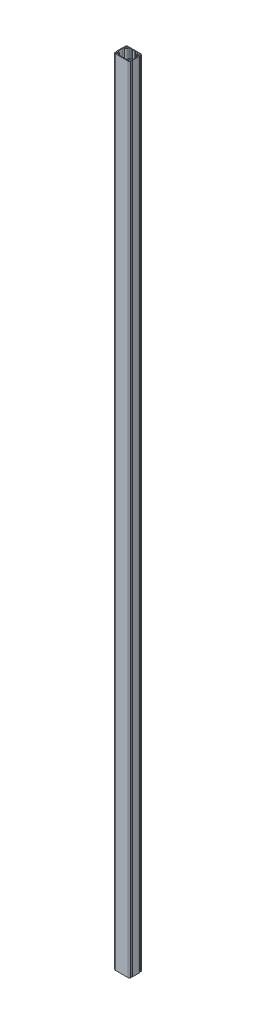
ISO-10303-21;
HEADER;
FILE_DESCRIPTION(('STEP AP214'),'2;1');
FILE_NAME('part.step','',(''),(''),'','','');
FILE_SCHEMA(('AUTOMOTIVE_DESIGN { 1 0 10303 214 1 1 1 1 }'));
ENDSEC;
DATA;
#1=APPLICATION_CONTEXT('core data for automotive mechanical design processes');
#2=APPLICATION_PROTOCOL_DEFINITION('international standard','automotive_design',2000,#1);
#3=PRODUCT_CONTEXT('',#1,'mechanical');
#4=PRODUCT('Part','Part','',(#3));
#5=PRODUCT_RELATED_PRODUCT_CATEGORY('part','',(#4));
#6=PRODUCT_DEFINITION_FORMATION('','',#4);
#7=PRODUCT_DEFINITION_CONTEXT('part definition',#1,'design');
#8=PRODUCT_DEFINITION('design','',#6,#7);
#9=PRODUCT_DEFINITION_SHAPE('','',#8);
#10=(LENGTH_UNIT() NAMED_UNIT(*) SI_UNIT(.MILLI.,.METRE.));
#11=(NAMED_UNIT(*) PLANE_ANGLE_UNIT() SI_UNIT($,.RADIAN.));
#12=(NAMED_UNIT(*) SI_UNIT($,.STERADIAN.) SOLID_ANGLE_UNIT());
#13=UNCERTAINTY_MEASURE_WITH_UNIT(LENGTH_MEASURE(1.E-05),#10,'distance_accuracy_value','');
#14=(GEOMETRIC_REPRESENTATION_CONTEXT(3) GLOBAL_UNCERTAINTY_ASSIGNED_CONTEXT((#13)) GLOBAL_UNIT_ASSIGNED_CONTEXT((#10,
#11,#12)) REPRESENTATION_CONTEXT('',''));
#15=CARTESIAN_POINT('',(0.,0.,0.));
#16=DIRECTION('',(0.,0.,1.));
#17=DIRECTION('',(1.,0.,0.));
#18=AXIS2_PLACEMENT_3D('',#15,#16,#17);
#19=CARTESIAN_POINT('',(-39.5,5000.,-17.8456725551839));
#20=DIRECTION('',(0.,-1.,0.));
#21=DIRECTION('',(0.,0.,-1.));
#22=AXIS2_PLACEMENT_3D('',#19,#20,#21);
#23=CYLINDRICAL_SURFACE('',#22,10.5);
#24=CARTESIAN_POINT('',(-39.5,0.,-17.8456725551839));
#25=DIRECTION('',(0.,1.,0.));
#26=DIRECTION('',(0.,0.,1.));
#27=AXIS2_PLACEMENT_3D('',#24,#25,#26);
#28=CIRCLE('',#27,10.5);
#29=CARTESIAN_POINT('',(-29.,0.,-17.8456725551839));
#30=VERTEX_POINT('',#29);
#31=CARTESIAN_POINT('',(-39.5,0.,-7.34567255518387));
#32=VERTEX_POINT('',#31);
#33=EDGE_CURVE('E472',#30,#32,#28,.F.);
#34=ORIENTED_EDGE('',*,*,#33,.F.);
#35=DIRECTION('',(0.,-1.,0.));
#36=VECTOR('',#35,1.);
#37=CARTESIAN_POINT('',(-29.,5000.,-17.8456725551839));
#38=LINE('',#37,#36);
#39=CARTESIAN_POINT('',(-29.,5000.,-17.8456725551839));
#40=VERTEX_POINT('',#39);
#41=EDGE_CURVE('E13',#40,#30,#38,.T.);
#42=ORIENTED_EDGE('',*,*,#41,.F.);
#43=CARTESIAN_POINT('',(-39.5,5000.,-17.8456725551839));
#44=DIRECTION('',(0.,1.,0.));
#45=DIRECTION('',(0.,0.,1.));
#46=AXIS2_PLACEMENT_3D('',#43,#44,#45);
#47=CIRCLE('',#46,10.5);
#48=CARTESIAN_POINT('',(-39.5,5000.,-7.34567255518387));
#49=VERTEX_POINT('',#48);
#50=EDGE_CURVE('E727',#40,#49,#47,.F.);
#51=ORIENTED_EDGE('',*,*,#50,.T.);
#52=DIRECTION('',(0.,-1.,0.));
#53=VECTOR('',#52,1.);
#54=CARTESIAN_POINT('',(-39.5,5000.,-7.34567255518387));
#55=LINE('',#54,#53);
#56=EDGE_CURVE('E232',#49,#32,#55,.T.);
#57=ORIENTED_EDGE('',*,*,#56,.T.);
#58=EDGE_LOOP('',(#34,#42,#51,#57));
#59=FACE_BOUND('',#58,.T.);
#60=ADVANCED_FACE('F46',(#59),#23,.T.);
#61=CARTESIAN_POINT('',(-22.5,5000.,-17.8456725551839));
#62=DIRECTION('',(0.,-1.,0.));
#63=DIRECTION('',(0.,0.,-1.));
#64=AXIS2_PLACEMENT_3D('',#61,#62,#63);
#65=CYLINDRICAL_SURFACE('',#64,6.49999999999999);
#66=CARTESIAN_POINT('',(-22.5,0.,-17.8456725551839));
#67=DIRECTION('',(0.,1.,0.));
#68=DIRECTION('',(0.,0.,1.));
#69=AXIS2_PLACEMENT_3D('',#66,#67,#68);
#70=CIRCLE('',#69,6.49999999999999);
#71=CARTESIAN_POINT('',(-22.5,0.,-24.3456725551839));
#72=VERTEX_POINT('',#71);
#73=EDGE_CURVE('E474',#30,#72,#70,.F.);
#74=ORIENTED_EDGE('',*,*,#73,.T.);
#75=DIRECTION('',(0.,-1.,0.));
#76=VECTOR('',#75,1.);
#77=CARTESIAN_POINT('',(-22.5,5000.,-24.3456725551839));
#78=LINE('',#77,#76);
#79=CARTESIAN_POINT('',(-22.5,5000.,-24.3456725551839));
#80=VERTEX_POINT('',#79);
#81=EDGE_CURVE('E56',#80,#72,#78,.T.);
#82=ORIENTED_EDGE('',*,*,#81,.F.);
#83=CARTESIAN_POINT('',(-22.5,5000.,-17.8456725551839));
#84=DIRECTION('',(0.,1.,0.));
#85=DIRECTION('',(0.,0.,1.));
#86=AXIS2_PLACEMENT_3D('',#83,#84,#85);
#87=CIRCLE('',#86,6.49999999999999);
#88=EDGE_CURVE('E729',#40,#80,#87,.F.);
#89=ORIENTED_EDGE('',*,*,#88,.F.);
#90=ORIENTED_EDGE('',*,*,#41,.T.);
#91=EDGE_LOOP('',(#74,#82,#89,#90));
#92=FACE_BOUND('',#91,.T.);
#93=ADVANCED_FACE('F822',(#92),#65,.F.);
#94=CARTESIAN_POINT('',(0.,5000.,-24.3456725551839));
#95=DIRECTION('',(0.,0.,-1.));
#96=DIRECTION('',(-1.,0.,0.));
#97=AXIS2_PLACEMENT_3D('',#94,#95,#96);
#98=PLANE('',#97);
#99=DIRECTION('',(1.,0.,0.));
#100=VECTOR('',#99,1.);
#101=CARTESIAN_POINT('',(0.,0.,-24.3456725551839));
#102=LINE('',#101,#100);
#103=CARTESIAN_POINT('',(-12.5,0.,-24.3456725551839));
#104=VERTEX_POINT('',#103);
#105=EDGE_CURVE('E477',#72,#104,#102,.T.);
#106=ORIENTED_EDGE('',*,*,#105,.T.);
#107=DIRECTION('',(0.,-1.,0.));
#108=VECTOR('',#107,1.);
#109=CARTESIAN_POINT('',(-12.5,5000.,-24.3456725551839));
#110=LINE('',#109,#108);
#111=CARTESIAN_POINT('',(-12.5,5000.,-24.3456725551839));
#112=VERTEX_POINT('',#111);
#113=EDGE_CURVE('E618',#112,#104,#110,.T.);
#114=ORIENTED_EDGE('',*,*,#113,.F.);
#115=DIRECTION('',(1.,0.,0.));
#116=VECTOR('',#115,1.);
#117=CARTESIAN_POINT('',(0.,5000.,-24.3456725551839));
#118=LINE('',#117,#116);
#119=EDGE_CURVE('E732',#80,#112,#118,.T.);
#120=ORIENTED_EDGE('',*,*,#119,.F.);
#121=ORIENTED_EDGE('',*,*,#81,.T.);
#122=EDGE_LOOP('',(#106,#114,#120,#121));
#123=FACE_BOUND('',#122,.T.);
#124=ADVANCED_FACE('F827',(#123),#98,.F.);
#125=CARTESIAN_POINT('',(5.92283627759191,5000.,-5.9228362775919));
#126=DIRECTION('',(-0.707106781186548,0.,0.707106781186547));
#127=DIRECTION('',(0.707106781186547,0.,0.707106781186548));
#128=AXIS2_PLACEMENT_3D('',#125,#126,#127);
#129=PLANE('',#128);
#130=DIRECTION('',(-0.707106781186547,0.,-0.707106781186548));
#131=VECTOR('',#130,1.);
#132=CARTESIAN_POINT('',(5.92283627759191,0.,-5.9228362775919));
#133=LINE('',#132,#131);
#134=CARTESIAN_POINT('',(-11.,0.,-22.8456725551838));
#135=VERTEX_POINT('',#134);
#136=EDGE_CURVE('E480',#135,#104,#133,.T.);
#137=ORIENTED_EDGE('',*,*,#136,.F.);
#138=DIRECTION('',(0.,-1.,0.));
#139=VECTOR('',#138,1.);
#140=CARTESIAN_POINT('',(-11.,5000.,-22.8456725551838));
#141=LINE('',#140,#139);
#142=CARTESIAN_POINT('',(-11.,5000.,-22.8456725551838));
#143=VERTEX_POINT('',#142);
#144=EDGE_CURVE('E616',#143,#135,#141,.T.);
#145=ORIENTED_EDGE('',*,*,#144,.F.);
#146=DIRECTION('',(-0.707106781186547,0.,-0.707106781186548));
#147=VECTOR('',#146,1.);
#148=CARTESIAN_POINT('',(5.92283627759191,5000.,-5.9228362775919));
#149=LINE('',#148,#147);
#150=EDGE_CURVE('E734',#143,#112,#149,.T.);
#151=ORIENTED_EDGE('',*,*,#150,.T.);
#152=ORIENTED_EDGE('',*,*,#113,.T.);
#153=EDGE_LOOP('',(#137,#145,#151,#152));
#154=FACE_BOUND('',#153,.T.);
#155=ADVANCED_FACE('F1338',(#154),#129,.T.);
#156=CARTESIAN_POINT('',(0.,5000.,-22.8456725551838));
#157=DIRECTION('',(0.,0.,-1.));
#158=DIRECTION('',(-1.,0.,0.));
#159=AXIS2_PLACEMENT_3D('',#156,#157,#158);
#160=PLANE('',#159);
#161=DIRECTION('',(1.,0.,0.));
#162=VECTOR('',#161,1.);
#163=CARTESIAN_POINT('',(0.,0.,-22.8456725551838));
#164=LINE('',#163,#162);
#165=CARTESIAN_POINT('',(-8.,0.,-22.8456725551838));
#166=VERTEX_POINT('',#165);
#167=EDGE_CURVE('E483',#135,#166,#164,.T.);
#168=ORIENTED_EDGE('',*,*,#167,.T.);
#169=DIRECTION('',(0.,-1.,0.));
#170=VECTOR('',#169,1.);
#171=CARTESIAN_POINT('',(-8.,5000.,-22.8456725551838));
#172=LINE('',#171,#170);
#173=CARTESIAN_POINT('',(-8.,5000.,-22.8456725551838));
#174=VERTEX_POINT('',#173);
#175=EDGE_CURVE('E613',#174,#166,#172,.T.);
#176=ORIENTED_EDGE('',*,*,#175,.F.);
#177=DIRECTION('',(1.,0.,0.));
#178=VECTOR('',#177,1.);
#179=CARTESIAN_POINT('',(0.,5000.,-22.8456725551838));
#180=LINE('',#179,#178);
#181=EDGE_CURVE('E737',#143,#174,#180,.T.);
#182=ORIENTED_EDGE('',*,*,#181,.F.);
#183=ORIENTED_EDGE('',*,*,#144,.T.);
#184=EDGE_LOOP('',(#168,#176,#182,#183));
#185=FACE_BOUND('',#184,.T.);
#186=ADVANCED_FACE('F1328',(#185),#160,.F.);
#187=CARTESIAN_POINT('',(-15.4228362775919,5000.,-15.422836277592));
#188=DIRECTION('',(-0.707106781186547,0.,-0.707106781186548));
#189=DIRECTION('',(-0.707106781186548,0.,0.707106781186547));
#190=AXIS2_PLACEMENT_3D('',#187,#188,#189);
#191=PLANE('',#190);
#192=DIRECTION('',(0.707106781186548,0.,-0.707106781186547));
#193=VECTOR('',#192,1.);
#194=CARTESIAN_POINT('',(-15.4228362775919,0.,-15.422836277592));
#195=LINE('',#194,#193);
#196=CARTESIAN_POINT('',(-6.50000000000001,0.,-24.3456725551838));
#197=VERTEX_POINT('',#196);
#198=EDGE_CURVE('E486',#166,#197,#195,.T.);
#199=ORIENTED_EDGE('',*,*,#198,.T.);
#200=DIRECTION('',(0.,-1.,0.));
#201=VECTOR('',#200,1.);
#202=CARTESIAN_POINT('',(-6.50000000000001,5000.,-24.3456725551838));
#203=LINE('',#202,#201);
#204=CARTESIAN_POINT('',(-6.50000000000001,5000.,-24.3456725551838));
#205=VERTEX_POINT('',#204);
#206=EDGE_CURVE('E611',#205,#197,#203,.T.);
#207=ORIENTED_EDGE('',*,*,#206,.F.);
#208=DIRECTION('',(0.707106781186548,0.,-0.707106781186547));
#209=VECTOR('',#208,1.);
#210=CARTESIAN_POINT('',(-15.4228362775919,5000.,-15.422836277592));
#211=LINE('',#210,#209);
#212=EDGE_CURVE('E740',#174,#205,#211,.T.);
#213=ORIENTED_EDGE('',*,*,#212,.F.);
#214=ORIENTED_EDGE('',*,*,#175,.T.);
#215=EDGE_LOOP('',(#199,#207,#213,#214));
#216=FACE_BOUND('',#215,.T.);
#217=ADVANCED_FACE('F1317',(#216),#191,.F.);
#218=CARTESIAN_POINT('',(0.,5000.,-24.3456725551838));
#219=DIRECTION('',(0.,0.,1.));
#220=DIRECTION('',(1.,0.,0.));
#221=AXIS2_PLACEMENT_3D('',#218,#219,#220);
#222=PLANE('',#221);
#223=DIRECTION('',(-1.,0.,0.));
#224=VECTOR('',#223,1.);
#225=CARTESIAN_POINT('',(0.,0.,-24.3456725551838));
#226=LINE('',#225,#224);
#227=CARTESIAN_POINT('',(6.50000000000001,0.,-24.3456725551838));
#228=VERTEX_POINT('',#227);
#229=EDGE_CURVE('E489',#228,#197,#226,.T.);
#230=ORIENTED_EDGE('',*,*,#229,.F.);
#231=DIRECTION('',(0.,-1.,0.));
#232=VECTOR('',#231,1.);
#233=CARTESIAN_POINT('',(6.50000000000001,5000.,-24.3456725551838));
#234=LINE('',#233,#232);
#235=CARTESIAN_POINT('',(6.50000000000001,5000.,-24.3456725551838));
#236=VERTEX_POINT('',#235);
#237=EDGE_CURVE('E609',#236,#228,#234,.T.);
#238=ORIENTED_EDGE('',*,*,#237,.F.);
#239=DIRECTION('',(-1.,0.,0.));
#240=VECTOR('',#239,1.);
#241=CARTESIAN_POINT('',(0.,5000.,-24.3456725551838));
#242=LINE('',#241,#240);
#243=EDGE_CURVE('E742',#236,#205,#242,.T.);
#244=ORIENTED_EDGE('',*,*,#243,.T.);
#245=ORIENTED_EDGE('',*,*,#206,.T.);
#246=EDGE_LOOP('',(#230,#238,#244,#245));
#247=FACE_BOUND('',#246,.T.);
#248=ADVANCED_FACE('F1307',(#247),#222,.T.);
#249=CARTESIAN_POINT('',(15.4228362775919,5000.,-15.422836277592));
#250=DIRECTION('',(-0.707106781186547,0.,0.707106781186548));
#251=DIRECTION('',(0.707106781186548,0.,0.707106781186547));
#252=AXIS2_PLACEMENT_3D('',#249,#250,#251);
#253=PLANE('',#252);
#254=DIRECTION('',(-0.707106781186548,0.,-0.707106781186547));
#255=VECTOR('',#254,1.);
#256=CARTESIAN_POINT('',(15.4228362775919,0.,-15.422836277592));
#257=LINE('',#256,#255);
#258=CARTESIAN_POINT('',(8.,0.,-22.8456725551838));
#259=VERTEX_POINT('',#258);
#260=EDGE_CURVE('E492',#259,#228,#257,.T.);
#261=ORIENTED_EDGE('',*,*,#260,.F.);
#262=DIRECTION('',(0.,-1.,0.));
#263=VECTOR('',#262,1.);
#264=CARTESIAN_POINT('',(8.,5000.,-22.8456725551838));
#265=LINE('',#264,#263);
#266=CARTESIAN_POINT('',(8.,5000.,-22.8456725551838));
#267=VERTEX_POINT('',#266);
#268=EDGE_CURVE('E607',#267,#259,#265,.T.);
#269=ORIENTED_EDGE('',*,*,#268,.F.);
#270=DIRECTION('',(-0.707106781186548,0.,-0.707106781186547));
#271=VECTOR('',#270,1.);
#272=CARTESIAN_POINT('',(15.4228362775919,5000.,-15.422836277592));
#273=LINE('',#272,#271);
#274=EDGE_CURVE('E745',#267,#236,#273,.T.);
#275=ORIENTED_EDGE('',*,*,#274,.T.);
#276=ORIENTED_EDGE('',*,*,#237,.T.);
#277=EDGE_LOOP('',(#261,#269,#275,#276));
#278=FACE_BOUND('',#277,.T.);
#279=ADVANCED_FACE('F1297',(#278),#253,.T.);
#280=CARTESIAN_POINT('',(0.,5000.,-22.8456725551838));
#281=DIRECTION('',(0.,0.,1.));
#282=DIRECTION('',(1.,0.,0.));
#283=AXIS2_PLACEMENT_3D('',#280,#281,#282);
#284=PLANE('',#283);
#285=DIRECTION('',(-1.,0.,0.));
#286=VECTOR('',#285,1.);
#287=CARTESIAN_POINT('',(0.,0.,-22.8456725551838));
#288=LINE('',#287,#286);
#289=CARTESIAN_POINT('',(11.,0.,-22.8456725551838));
#290=VERTEX_POINT('',#289);
#291=EDGE_CURVE('E495',#290,#259,#288,.T.);
#292=ORIENTED_EDGE('',*,*,#291,.F.);
#293=DIRECTION('',(0.,-1.,0.));
#294=VECTOR('',#293,1.);
#295=CARTESIAN_POINT('',(11.,5000.,-22.8456725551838));
#296=LINE('',#295,#294);
#297=CARTESIAN_POINT('',(11.,5000.,-22.8456725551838));
#298=VERTEX_POINT('',#297);
#299=EDGE_CURVE('E605',#298,#290,#296,.T.);
#300=ORIENTED_EDGE('',*,*,#299,.F.);
#301=DIRECTION('',(-1.,0.,0.));
#302=VECTOR('',#301,1.);
#303=CARTESIAN_POINT('',(0.,5000.,-22.8456725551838));
#304=LINE('',#303,#302);
#305=EDGE_CURVE('E748',#298,#267,#304,.T.);
#306=ORIENTED_EDGE('',*,*,#305,.T.);
#307=ORIENTED_EDGE('',*,*,#268,.T.);
#308=EDGE_LOOP('',(#292,#300,#306,#307));
#309=FACE_BOUND('',#308,.T.);
#310=ADVANCED_FACE('F1287',(#309),#284,.T.);
#311=CARTESIAN_POINT('',(-5.92283627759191,5000.,-5.9228362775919));
#312=DIRECTION('',(-0.707106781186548,0.,-0.707106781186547));
#313=DIRECTION('',(-0.707106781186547,0.,0.707106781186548));
#314=AXIS2_PLACEMENT_3D('',#311,#312,#313);
#315=PLANE('',#314);
#316=DIRECTION('',(0.707106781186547,0.,-0.707106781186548));
#317=VECTOR('',#316,1.);
#318=CARTESIAN_POINT('',(-5.92283627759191,0.,-5.9228362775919));
#319=LINE('',#318,#317);
#320=CARTESIAN_POINT('',(12.5,0.,-24.3456725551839));
#321=VERTEX_POINT('',#320);
#322=EDGE_CURVE('E498',#290,#321,#319,.T.);
#323=ORIENTED_EDGE('',*,*,#322,.T.);
#324=DIRECTION('',(0.,-1.,0.));
#325=VECTOR('',#324,1.);
#326=CARTESIAN_POINT('',(12.5,5000.,-24.3456725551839));
#327=LINE('',#326,#325);
#328=CARTESIAN_POINT('',(12.5,5000.,-24.3456725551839));
#329=VERTEX_POINT('',#328);
#330=EDGE_CURVE('E603',#329,#321,#327,.T.);
#331=ORIENTED_EDGE('',*,*,#330,.F.);
#332=DIRECTION('',(0.707106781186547,0.,-0.707106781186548));
#333=VECTOR('',#332,1.);
#334=CARTESIAN_POINT('',(-5.92283627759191,5000.,-5.9228362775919));
#335=LINE('',#334,#333);
#336=EDGE_CURVE('E751',#298,#329,#335,.T.);
#337=ORIENTED_EDGE('',*,*,#336,.F.);
#338=ORIENTED_EDGE('',*,*,#299,.T.);
#339=EDGE_LOOP('',(#323,#331,#337,#338));
#340=FACE_BOUND('',#339,.T.);
#341=ADVANCED_FACE('F1276',(#340),#315,.F.);
#342=CARTESIAN_POINT('',(0.,5000.,-24.3456725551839));
#343=DIRECTION('',(0.,0.,1.));
#344=DIRECTION('',(1.,0.,0.));
#345=AXIS2_PLACEMENT_3D('',#342,#343,#344);
#346=PLANE('',#345);
#347=DIRECTION('',(-1.,0.,0.));
#348=VECTOR('',#347,1.);
#349=CARTESIAN_POINT('',(0.,0.,-24.3456725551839));
#350=LINE('',#349,#348);
#351=CARTESIAN_POINT('',(22.5,0.,-24.3456725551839));
#352=VERTEX_POINT('',#351);
#353=EDGE_CURVE('E501',#352,#321,#350,.T.);
#354=ORIENTED_EDGE('',*,*,#353,.F.);
#355=DIRECTION('',(0.,-1.,0.));
#356=VECTOR('',#355,1.);
#357=CARTESIAN_POINT('',(22.5,5000.,-24.3456725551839));
#358=LINE('',#357,#356);
#359=CARTESIAN_POINT('',(22.5,5000.,-24.3456725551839));
#360=VERTEX_POINT('',#359);
#361=EDGE_CURVE('E601',#360,#352,#358,.T.);
#362=ORIENTED_EDGE('',*,*,#361,.F.);
#363=DIRECTION('',(-1.,0.,0.));
#364=VECTOR('',#363,1.);
#365=CARTESIAN_POINT('',(0.,5000.,-24.3456725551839));
#366=LINE('',#365,#364);
#367=EDGE_CURVE('E753',#360,#329,#366,.T.);
#368=ORIENTED_EDGE('',*,*,#367,.T.);
#369=ORIENTED_EDGE('',*,*,#330,.T.);
#370=EDGE_LOOP('',(#354,#362,#368,#369));
#371=FACE_BOUND('',#370,.T.);
#372=ADVANCED_FACE('F1266',(#371),#346,.T.);
#373=CARTESIAN_POINT('',(22.5,5000.,-17.8456725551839));
#374=DIRECTION('',(0.,-1.,0.));
#375=DIRECTION('',(0.,0.,-1.));
#376=AXIS2_PLACEMENT_3D('',#373,#374,#375);
#377=CYLINDRICAL_SURFACE('',#376,6.49999999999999);
#378=CARTESIAN_POINT('',(22.5,0.,-17.8456725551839));
#379=DIRECTION('',(0.,1.,0.));
#380=DIRECTION('',(0.,0.,1.));
#381=AXIS2_PLACEMENT_3D('',#378,#379,#380);
#382=CIRCLE('',#381,6.49999999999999);
#383=CARTESIAN_POINT('',(29.,0.,-17.8456725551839));
#384=VERTEX_POINT('',#383);
#385=EDGE_CURVE('E504',#384,#352,#382,.T.);
#386=ORIENTED_EDGE('',*,*,#385,.F.);
#387=DIRECTION('',(0.,-1.,0.));
#388=VECTOR('',#387,1.);
#389=CARTESIAN_POINT('',(29.,5000.,-17.8456725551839));
#390=LINE('',#389,#388);
#391=CARTESIAN_POINT('',(29.,5000.,-17.8456725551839));
#392=VERTEX_POINT('',#391);
#393=EDGE_CURVE('E599',#392,#384,#390,.T.);
#394=ORIENTED_EDGE('',*,*,#393,.F.);
#395=CARTESIAN_POINT('',(22.5,5000.,-17.8456725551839));
#396=DIRECTION('',(0.,1.,0.));
#397=DIRECTION('',(0.,0.,1.));
#398=AXIS2_PLACEMENT_3D('',#395,#396,#397);
#399=CIRCLE('',#398,6.49999999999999);
#400=EDGE_CURVE('E756',#392,#360,#399,.T.);
#401=ORIENTED_EDGE('',*,*,#400,.T.);
#402=ORIENTED_EDGE('',*,*,#361,.T.);
#403=EDGE_LOOP('',(#386,#394,#401,#402));
#404=FACE_BOUND('',#403,.T.);
#405=ADVANCED_FACE('F1256',(#404),#377,.F.);
#406=CARTESIAN_POINT('',(39.5,5000.,-17.8456725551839));
#407=DIRECTION('',(0.,-1.,0.));
#408=DIRECTION('',(0.,0.,-1.));
#409=AXIS2_PLACEMENT_3D('',#406,#407,#408);
#410=CYLINDRICAL_SURFACE('',#409,10.5);
#411=CARTESIAN_POINT('',(39.5,0.,-17.8456725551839));
#412=DIRECTION('',(0.,1.,0.));
#413=DIRECTION('',(0.,0.,1.));
#414=AXIS2_PLACEMENT_3D('',#411,#412,#413);
#415=CIRCLE('',#414,10.5);
#416=CARTESIAN_POINT('',(39.5,0.,-7.34567255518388));
#417=VERTEX_POINT('',#416);
#418=EDGE_CURVE('E507',#384,#417,#415,.T.);
#419=ORIENTED_EDGE('',*,*,#418,.T.);
#420=DIRECTION('',(0.,-1.,0.));
#421=VECTOR('',#420,1.);
#422=CARTESIAN_POINT('',(39.5,5000.,-7.34567255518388));
#423=LINE('',#422,#421);
#424=CARTESIAN_POINT('',(39.5,5000.,-7.34567255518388));
#425=VERTEX_POINT('',#424);
#426=EDGE_CURVE('E597',#425,#417,#423,.T.);
#427=ORIENTED_EDGE('',*,*,#426,.F.);
#428=CARTESIAN_POINT('',(39.5,5000.,-17.8456725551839));
#429=DIRECTION('',(0.,1.,0.));
#430=DIRECTION('',(0.,0.,1.));
#431=AXIS2_PLACEMENT_3D('',#428,#429,#430);
#432=CIRCLE('',#431,10.5);
#433=EDGE_CURVE('E759',#392,#425,#432,.T.);
#434=ORIENTED_EDGE('',*,*,#433,.F.);
#435=ORIENTED_EDGE('',*,*,#393,.T.);
#436=EDGE_LOOP('',(#419,#427,#434,#435));
#437=FACE_BOUND('',#436,.T.);
#438=ADVANCED_FACE('F1246',(#437),#410,.T.);
#439=CARTESIAN_POINT('',(39.5,5000.,-0.845672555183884));
#440=DIRECTION('',(0.,-1.,0.));
#441=DIRECTION('',(0.,0.,-1.));
#442=AXIS2_PLACEMENT_3D('',#439,#440,#441);
#443=CYLINDRICAL_SURFACE('',#442,6.49999999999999);
#444=CARTESIAN_POINT('',(39.5,0.,-0.845672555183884));
#445=DIRECTION('',(0.,1.,0.));
#446=DIRECTION('',(0.,0.,1.));
#447=AXIS2_PLACEMENT_3D('',#444,#445,#446);
#448=CIRCLE('',#447,6.49999999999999);
#449=CARTESIAN_POINT('',(46.,0.,-0.845672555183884));
#450=VERTEX_POINT('',#449);
#451=EDGE_CURVE('E510',#450,#417,#448,.T.);
#452=ORIENTED_EDGE('',*,*,#451,.F.);
#453=DIRECTION('',(0.,-1.,0.));
#454=VECTOR('',#453,1.);
#455=CARTESIAN_POINT('',(46.,5000.,-0.845672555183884));
#456=LINE('',#455,#454);
#457=CARTESIAN_POINT('',(46.,5000.,-0.845672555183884));
#458=VERTEX_POINT('',#457);
#459=EDGE_CURVE('E595',#458,#450,#456,.T.);
#460=ORIENTED_EDGE('',*,*,#459,.F.);
#461=CARTESIAN_POINT('',(39.5,5000.,-0.845672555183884));
#462=DIRECTION('',(0.,1.,0.));
#463=DIRECTION('',(0.,0.,1.));
#464=AXIS2_PLACEMENT_3D('',#461,#462,#463);
#465=CIRCLE('',#464,6.49999999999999);
#466=EDGE_CURVE('E761',#458,#425,#465,.T.);
#467=ORIENTED_EDGE('',*,*,#466,.T.);
#468=ORIENTED_EDGE('',*,*,#426,.T.);
#469=EDGE_LOOP('',(#452,#460,#467,#468));
#470=FACE_BOUND('',#469,.T.);
#471=ADVANCED_FACE('F1235',(#470),#443,.F.);
#472=CARTESIAN_POINT('',(46.,5000.,0.));
#473=DIRECTION('',(-1.,0.,0.));
#474=DIRECTION('',(0.,0.,1.));
#475=AXIS2_PLACEMENT_3D('',#472,#473,#474);
#476=PLANE('',#475);
#477=DIRECTION('',(0.,0.,-1.));
#478=VECTOR('',#477,1.);
#479=CARTESIAN_POINT('',(46.,0.,0.));
#480=LINE('',#479,#478);
#481=CARTESIAN_POINT('',(46.,0.,24.1543274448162));
#482=VERTEX_POINT('',#481);
#483=EDGE_CURVE('E513',#482,#450,#480,.T.);
#484=ORIENTED_EDGE('',*,*,#483,.F.);
#485=DIRECTION('',(0.,-1.,0.));
#486=VECTOR('',#485,1.);
#487=CARTESIAN_POINT('',(46.,5000.,24.1543274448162));
#488=LINE('',#487,#486);
#489=CARTESIAN_POINT('',(46.,5000.,24.1543274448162));
#490=VERTEX_POINT('',#489);
#491=EDGE_CURVE('E593',#490,#482,#488,.T.);
#492=ORIENTED_EDGE('',*,*,#491,.F.);
#493=DIRECTION('',(0.,0.,-1.));
#494=VECTOR('',#493,1.);
#495=CARTESIAN_POINT('',(46.,5000.,0.));
#496=LINE('',#495,#494);
#497=EDGE_CURVE('E764',#490,#458,#496,.T.);
#498=ORIENTED_EDGE('',*,*,#497,.T.);
#499=ORIENTED_EDGE('',*,*,#459,.T.);
#500=EDGE_LOOP('',(#484,#492,#498,#499));
#501=FACE_BOUND('',#500,.T.);
#502=ADVANCED_FACE('F1225',(#501),#476,.T.);
#503=CARTESIAN_POINT('',(39.5,5000.,24.1543274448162));
#504=DIRECTION('',(0.,-1.,0.));
#505=DIRECTION('',(0.,0.,-1.));
#506=AXIS2_PLACEMENT_3D('',#503,#504,#505);
#507=CYLINDRICAL_SURFACE('',#506,6.49999999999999);
#508=CARTESIAN_POINT('',(39.5,0.,24.1543274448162));
#509=DIRECTION('',(0.,1.,0.));
#510=DIRECTION('',(0.,0.,1.));
#511=AXIS2_PLACEMENT_3D('',#508,#509,#510);
#512=CIRCLE('',#511,6.49999999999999);
#513=CARTESIAN_POINT('',(39.5,0.,30.6543274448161));
#514=VERTEX_POINT('',#513);
#515=EDGE_CURVE('E516',#482,#514,#512,.F.);
#516=ORIENTED_EDGE('',*,*,#515,.T.);
#517=DIRECTION('',(0.,-1.,0.));
#518=VECTOR('',#517,1.);
#519=CARTESIAN_POINT('',(39.5,5000.,30.6543274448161));
#520=LINE('',#519,#518);
#521=CARTESIAN_POINT('',(39.5,5000.,30.6543274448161));
#522=VERTEX_POINT('',#521);
#523=EDGE_CURVE('E591',#522,#514,#520,.T.);
#524=ORIENTED_EDGE('',*,*,#523,.F.);
#525=CARTESIAN_POINT('',(39.5,5000.,24.1543274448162));
#526=DIRECTION('',(0.,1.,0.));
#527=DIRECTION('',(0.,0.,1.));
#528=AXIS2_PLACEMENT_3D('',#525,#526,#527);
#529=CIRCLE('',#528,6.49999999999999);
#530=EDGE_CURVE('E767',#490,#522,#529,.F.);
#531=ORIENTED_EDGE('',*,*,#530,.F.);
#532=ORIENTED_EDGE('',*,*,#491,.T.);
#533=EDGE_LOOP('',(#516,#524,#531,#532));
#534=FACE_BOUND('',#533,.T.);
#535=ADVANCED_FACE('F1215',(#534),#507,.F.);
#536=CARTESIAN_POINT('',(39.5,5000.,41.1543274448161));
#537=DIRECTION('',(0.,-1.,0.));
#538=DIRECTION('',(0.,0.,-1.));
#539=AXIS2_PLACEMENT_3D('',#536,#537,#538);
#540=CYLINDRICAL_SURFACE('',#539,10.5);
#541=CARTESIAN_POINT('',(39.5,0.,41.1543274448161));
#542=DIRECTION('',(0.,1.,0.));
#543=DIRECTION('',(0.,0.,1.));
#544=AXIS2_PLACEMENT_3D('',#541,#542,#543);
#545=CIRCLE('',#544,10.5);
#546=CARTESIAN_POINT('',(29.,0.,41.1543274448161));
#547=VERTEX_POINT('',#546);
#548=EDGE_CURVE('E519',#547,#514,#545,.F.);
#549=ORIENTED_EDGE('',*,*,#548,.F.);
#550=DIRECTION('',(0.,-1.,0.));
#551=VECTOR('',#550,1.);
#552=CARTESIAN_POINT('',(29.,5000.,41.1543274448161));
#553=LINE('',#552,#551);
#554=CARTESIAN_POINT('',(29.,5000.,41.1543274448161));
#555=VERTEX_POINT('',#554);
#556=EDGE_CURVE('E589',#555,#547,#553,.T.);
#557=ORIENTED_EDGE('',*,*,#556,.F.);
#558=CARTESIAN_POINT('',(39.5,5000.,41.1543274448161));
#559=DIRECTION('',(0.,1.,0.));
#560=DIRECTION('',(0.,0.,1.));
#561=AXIS2_PLACEMENT_3D('',#558,#559,#560);
#562=CIRCLE('',#561,10.5);
#563=EDGE_CURVE('E769',#555,#522,#562,.F.);
#564=ORIENTED_EDGE('',*,*,#563,.T.);
#565=ORIENTED_EDGE('',*,*,#523,.T.);
#566=EDGE_LOOP('',(#549,#557,#564,#565));
#567=FACE_BOUND('',#566,.T.);
#568=ADVANCED_FACE('F1205',(#567),#540,.T.);
#569=CARTESIAN_POINT('',(22.5,5000.,41.1543274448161));
#570=DIRECTION('',(0.,-1.,0.));
#571=DIRECTION('',(0.,0.,-1.));
#572=AXIS2_PLACEMENT_3D('',#569,#570,#571);
#573=CYLINDRICAL_SURFACE('',#572,6.5);
#574=CARTESIAN_POINT('',(22.5,0.,41.1543274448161));
#575=DIRECTION('',(0.,1.,0.));
#576=DIRECTION('',(0.,0.,1.));
#577=AXIS2_PLACEMENT_3D('',#574,#575,#576);
#578=CIRCLE('',#577,6.5);
#579=CARTESIAN_POINT('',(22.5,0.,47.6543274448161));
#580=VERTEX_POINT('',#579);
#581=EDGE_CURVE('E522',#547,#580,#578,.F.);
#582=ORIENTED_EDGE('',*,*,#581,.T.);
#583=DIRECTION('',(0.,-1.,0.));
#584=VECTOR('',#583,1.);
#585=CARTESIAN_POINT('',(22.5,5000.,47.6543274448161));
#586=LINE('',#585,#584);
#587=CARTESIAN_POINT('',(22.5,5000.,47.6543274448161));
#588=VERTEX_POINT('',#587);
#589=EDGE_CURVE('E587',#588,#580,#586,.T.);
#590=ORIENTED_EDGE('',*,*,#589,.F.);
#591=CARTESIAN_POINT('',(22.5,5000.,41.1543274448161));
#592=DIRECTION('',(0.,1.,0.));
#593=DIRECTION('',(0.,0.,1.));
#594=AXIS2_PLACEMENT_3D('',#591,#592,#593);
#595=CIRCLE('',#594,6.5);
#596=EDGE_CURVE('E772',#555,#588,#595,.F.);
#597=ORIENTED_EDGE('',*,*,#596,.F.);
#598=ORIENTED_EDGE('',*,*,#556,.T.);
#599=EDGE_LOOP('',(#582,#590,#597,#598));
#600=FACE_BOUND('',#599,.T.);
#601=ADVANCED_FACE('F1195',(#600),#573,.F.);
#602=CARTESIAN_POINT('',(0.,5000.,47.6543274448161));
#603=DIRECTION('',(0.,0.,-1.));
#604=DIRECTION('',(-1.,0.,0.));
#605=AXIS2_PLACEMENT_3D('',#602,#603,#604);
#606=PLANE('',#605);
#607=DIRECTION('',(1.,0.,0.));
#608=VECTOR('',#607,1.);
#609=CARTESIAN_POINT('',(0.,0.,47.6543274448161));
#610=LINE('',#609,#608);
#611=CARTESIAN_POINT('',(12.5,0.,47.6543274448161));
#612=VERTEX_POINT('',#611);
#613=EDGE_CURVE('E525',#612,#580,#610,.T.);
#614=ORIENTED_EDGE('',*,*,#613,.F.);
#615=DIRECTION('',(0.,-1.,0.));
#616=VECTOR('',#615,1.);
#617=CARTESIAN_POINT('',(12.5,5000.,47.6543274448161));
#618=LINE('',#617,#616);
#619=CARTESIAN_POINT('',(12.5,5000.,47.6543274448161));
#620=VERTEX_POINT('',#619);
#621=EDGE_CURVE('E585',#620,#612,#618,.T.);
#622=ORIENTED_EDGE('',*,*,#621,.F.);
#623=DIRECTION('',(1.,0.,0.));
#624=VECTOR('',#623,1.);
#625=CARTESIAN_POINT('',(0.,5000.,47.6543274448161));
#626=LINE('',#625,#624);
#627=EDGE_CURVE('E774',#620,#588,#626,.T.);
#628=ORIENTED_EDGE('',*,*,#627,.T.);
#629=ORIENTED_EDGE('',*,*,#589,.T.);
#630=EDGE_LOOP('',(#614,#622,#628,#629));
#631=FACE_BOUND('',#630,.T.);
#632=ADVANCED_FACE('F1185',(#631),#606,.T.);
#633=CARTESIAN_POINT('',(-17.577163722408,5000.,17.577163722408));
#634=DIRECTION('',(0.707106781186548,0.,-0.707106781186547));
#635=DIRECTION('',(-0.707106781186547,0.,-0.707106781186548));
#636=AXIS2_PLACEMENT_3D('',#633,#634,#635);
#637=PLANE('',#636);
#638=DIRECTION('',(0.707106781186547,0.,0.707106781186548));
#639=VECTOR('',#638,1.);
#640=CARTESIAN_POINT('',(-17.577163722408,0.,17.577163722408));
#641=LINE('',#640,#639);
#642=CARTESIAN_POINT('',(11.,0.,46.1543274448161));
#643=VERTEX_POINT('',#642);
#644=EDGE_CURVE('E528',#643,#612,#641,.T.);
#645=ORIENTED_EDGE('',*,*,#644,.F.);
#646=DIRECTION('',(0.,-1.,0.));
#647=VECTOR('',#646,1.);
#648=CARTESIAN_POINT('',(11.,5000.,46.1543274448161));
#649=LINE('',#648,#647);
#650=CARTESIAN_POINT('',(11.,5000.,46.1543274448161));
#651=VERTEX_POINT('',#650);
#652=EDGE_CURVE('E583',#651,#643,#649,.T.);
#653=ORIENTED_EDGE('',*,*,#652,.F.);
#654=DIRECTION('',(0.707106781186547,0.,0.707106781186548));
#655=VECTOR('',#654,1.);
#656=CARTESIAN_POINT('',(-17.577163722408,5000.,17.577163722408));
#657=LINE('',#656,#655);
#658=EDGE_CURVE('E777',#651,#620,#657,.T.);
#659=ORIENTED_EDGE('',*,*,#658,.T.);
#660=ORIENTED_EDGE('',*,*,#621,.T.);
#661=EDGE_LOOP('',(#645,#653,#659,#660));
#662=FACE_BOUND('',#661,.T.);
#663=ADVANCED_FACE('F1175',(#662),#637,.T.);
#664=CARTESIAN_POINT('',(0.,5000.,46.1543274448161));
#665=DIRECTION('',(0.,0.,1.));
#666=DIRECTION('',(1.,0.,0.));
#667=AXIS2_PLACEMENT_3D('',#664,#665,#666);
#668=PLANE('',#667);
#669=DIRECTION('',(-1.,0.,0.));
#670=VECTOR('',#669,1.);
#671=CARTESIAN_POINT('',(0.,0.,46.1543274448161));
#672=LINE('',#671,#670);
#673=CARTESIAN_POINT('',(8.,0.,46.1543274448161));
#674=VERTEX_POINT('',#673);
#675=EDGE_CURVE('E531',#643,#674,#672,.T.);
#676=ORIENTED_EDGE('',*,*,#675,.T.);
#677=DIRECTION('',(0.,-1.,0.));
#678=VECTOR('',#677,1.);
#679=CARTESIAN_POINT('',(8.,5000.,46.1543274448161));
#680=LINE('',#679,#678);
#681=CARTESIAN_POINT('',(8.,5000.,46.1543274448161));
#682=VERTEX_POINT('',#681);
#683=EDGE_CURVE('E580',#682,#674,#680,.T.);
#684=ORIENTED_EDGE('',*,*,#683,.F.);
#685=DIRECTION('',(-1.,0.,0.));
#686=VECTOR('',#685,1.);
#687=CARTESIAN_POINT('',(0.,5000.,46.1543274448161));
#688=LINE('',#687,#686);
#689=EDGE_CURVE('E780',#651,#682,#688,.T.);
#690=ORIENTED_EDGE('',*,*,#689,.F.);
#691=ORIENTED_EDGE('',*,*,#652,.T.);
#692=EDGE_LOOP('',(#676,#684,#690,#691));
#693=FACE_BOUND('',#692,.T.);
#694=ADVANCED_FACE('F1165',(#693),#668,.F.);
#695=CARTESIAN_POINT('',(27.077163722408,5000.,27.0771637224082));
#696=DIRECTION('',(0.707106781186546,0.,0.707106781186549));
#697=DIRECTION('',(0.707106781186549,0.,-0.707106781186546));
#698=AXIS2_PLACEMENT_3D('',#695,#696,#697);
#699=PLANE('',#698);
#700=DIRECTION('',(-0.707106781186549,0.,0.707106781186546));
#701=VECTOR('',#700,1.);
#702=CARTESIAN_POINT('',(27.077163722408,0.,27.0771637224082));
#703=LINE('',#702,#701);
#704=CARTESIAN_POINT('',(6.50000000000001,0.,47.6543274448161));
#705=VERTEX_POINT('',#704);
#706=EDGE_CURVE('E534',#674,#705,#703,.T.);
#707=ORIENTED_EDGE('',*,*,#706,.T.);
#708=DIRECTION('',(0.,-1.,0.));
#709=VECTOR('',#708,1.);
#710=CARTESIAN_POINT('',(6.50000000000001,5000.,47.6543274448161));
#711=LINE('',#710,#709);
#712=CARTESIAN_POINT('',(6.50000000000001,5000.,47.6543274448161));
#713=VERTEX_POINT('',#712);
#714=EDGE_CURVE('E578',#713,#705,#711,.T.);
#715=ORIENTED_EDGE('',*,*,#714,.F.);
#716=DIRECTION('',(-0.707106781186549,0.,0.707106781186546));
#717=VECTOR('',#716,1.);
#718=CARTESIAN_POINT('',(27.077163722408,5000.,27.0771637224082));
#719=LINE('',#718,#717);
#720=EDGE_CURVE('E783',#682,#713,#719,.T.);
#721=ORIENTED_EDGE('',*,*,#720,.F.);
#722=ORIENTED_EDGE('',*,*,#683,.T.);
#723=EDGE_LOOP('',(#707,#715,#721,#722));
#724=FACE_BOUND('',#723,.T.);
#725=ADVANCED_FACE('F1155',(#724),#699,.F.);
#726=CARTESIAN_POINT('',(0.,5000.,47.6543274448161));
#727=DIRECTION('',(0.,0.,-1.));
#728=DIRECTION('',(-1.,0.,0.));
#729=AXIS2_PLACEMENT_3D('',#726,#727,#728);
#730=PLANE('',#729);
#731=DIRECTION('',(1.,0.,0.));
#732=VECTOR('',#731,1.);
#733=CARTESIAN_POINT('',(0.,0.,47.6543274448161));
#734=LINE('',#733,#732);
#735=CARTESIAN_POINT('',(-6.50000000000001,0.,47.6543274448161));
#736=VERTEX_POINT('',#735);
#737=EDGE_CURVE('E537',#736,#705,#734,.T.);
#738=ORIENTED_EDGE('',*,*,#737,.F.);
#739=DIRECTION('',(0.,-1.,0.));
#740=VECTOR('',#739,1.);
#741=CARTESIAN_POINT('',(-6.50000000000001,5000.,47.6543274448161));
#742=LINE('',#741,#740);
#743=CARTESIAN_POINT('',(-6.50000000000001,5000.,47.6543274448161));
#744=VERTEX_POINT('',#743);
#745=EDGE_CURVE('E576',#744,#736,#742,.T.);
#746=ORIENTED_EDGE('',*,*,#745,.F.);
#747=DIRECTION('',(1.,0.,0.));
#748=VECTOR('',#747,1.);
#749=CARTESIAN_POINT('',(0.,5000.,47.6543274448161));
#750=LINE('',#749,#748);
#751=EDGE_CURVE('E785',#744,#713,#750,.T.);
#752=ORIENTED_EDGE('',*,*,#751,.T.);
#753=ORIENTED_EDGE('',*,*,#714,.T.);
#754=EDGE_LOOP('',(#738,#746,#752,#753));
#755=FACE_BOUND('',#754,.T.);
#756=ADVANCED_FACE('F1145',(#755),#730,.T.);
#757=CARTESIAN_POINT('',(-27.077163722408,5000.,27.0771637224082));
#758=DIRECTION('',(0.707106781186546,0.,-0.707106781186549));
#759=DIRECTION('',(-0.707106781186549,0.,-0.707106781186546));
#760=AXIS2_PLACEMENT_3D('',#757,#758,#759);
#761=PLANE('',#760);
#762=DIRECTION('',(0.707106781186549,0.,0.707106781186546));
#763=VECTOR('',#762,1.);
#764=CARTESIAN_POINT('',(-27.077163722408,0.,27.0771637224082));
#765=LINE('',#764,#763);
#766=CARTESIAN_POINT('',(-8.,0.,46.1543274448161));
#767=VERTEX_POINT('',#766);
#768=EDGE_CURVE('E540',#767,#736,#765,.T.);
#769=ORIENTED_EDGE('',*,*,#768,.F.);
#770=DIRECTION('',(0.,-1.,0.));
#771=VECTOR('',#770,1.);
#772=CARTESIAN_POINT('',(-8.,5000.,46.1543274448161));
#773=LINE('',#772,#771);
#774=CARTESIAN_POINT('',(-8.,5000.,46.1543274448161));
#775=VERTEX_POINT('',#774);
#776=EDGE_CURVE('E574',#775,#767,#773,.T.);
#777=ORIENTED_EDGE('',*,*,#776,.F.);
#778=DIRECTION('',(0.707106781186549,0.,0.707106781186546));
#779=VECTOR('',#778,1.);
#780=CARTESIAN_POINT('',(-27.077163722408,5000.,27.0771637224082));
#781=LINE('',#780,#779);
#782=EDGE_CURVE('E788',#775,#744,#781,.T.);
#783=ORIENTED_EDGE('',*,*,#782,.T.);
#784=ORIENTED_EDGE('',*,*,#745,.T.);
#785=EDGE_LOOP('',(#769,#777,#783,#784));
#786=FACE_BOUND('',#785,.T.);
#787=ADVANCED_FACE('F1135',(#786),#761,.T.);
#788=CARTESIAN_POINT('',(0.,5000.,46.1543274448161));
#789=DIRECTION('',(0.,0.,-1.));
#790=DIRECTION('',(-1.,0.,0.));
#791=AXIS2_PLACEMENT_3D('',#788,#789,#790);
#792=PLANE('',#791);
#793=DIRECTION('',(1.,0.,0.));
#794=VECTOR('',#793,1.);
#795=CARTESIAN_POINT('',(0.,0.,46.1543274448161));
#796=LINE('',#795,#794);
#797=CARTESIAN_POINT('',(-11.,0.,46.1543274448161));
#798=VERTEX_POINT('',#797);
#799=EDGE_CURVE('E543',#798,#767,#796,.T.);
#800=ORIENTED_EDGE('',*,*,#799,.F.);
#801=DIRECTION('',(0.,-1.,0.));
#802=VECTOR('',#801,1.);
#803=CARTESIAN_POINT('',(-11.,5000.,46.1543274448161));
#804=LINE('',#803,#802);
#805=CARTESIAN_POINT('',(-11.,5000.,46.1543274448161));
#806=VERTEX_POINT('',#805);
#807=EDGE_CURVE('E572',#806,#798,#804,.T.);
#808=ORIENTED_EDGE('',*,*,#807,.F.);
#809=DIRECTION('',(1.,0.,0.));
#810=VECTOR('',#809,1.);
#811=CARTESIAN_POINT('',(0.,5000.,46.1543274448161));
#812=LINE('',#811,#810);
#813=EDGE_CURVE('E791',#806,#775,#812,.T.);
#814=ORIENTED_EDGE('',*,*,#813,.T.);
#815=ORIENTED_EDGE('',*,*,#776,.T.);
#816=EDGE_LOOP('',(#800,#808,#814,#815));
#817=FACE_BOUND('',#816,.T.);
#818=ADVANCED_FACE('F1125',(#817),#792,.T.);
#819=CARTESIAN_POINT('',(17.577163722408,5000.,17.577163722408));
#820=DIRECTION('',(0.707106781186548,0.,0.707106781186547));
#821=DIRECTION('',(0.707106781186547,0.,-0.707106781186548));
#822=AXIS2_PLACEMENT_3D('',#819,#820,#821);
#823=PLANE('',#822);
#824=DIRECTION('',(-0.707106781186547,0.,0.707106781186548));
#825=VECTOR('',#824,1.);
#826=CARTESIAN_POINT('',(17.577163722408,0.,17.577163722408));
#827=LINE('',#826,#825);
#828=CARTESIAN_POINT('',(-12.5,0.,47.6543274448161));
#829=VERTEX_POINT('',#828);
#830=EDGE_CURVE('E546',#798,#829,#827,.T.);
#831=ORIENTED_EDGE('',*,*,#830,.T.);
#832=DIRECTION('',(0.,-1.,0.));
#833=VECTOR('',#832,1.);
#834=CARTESIAN_POINT('',(-12.5,5000.,47.6543274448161));
#835=LINE('',#834,#833);
#836=CARTESIAN_POINT('',(-12.5,5000.,47.6543274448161));
#837=VERTEX_POINT('',#836);
#838=EDGE_CURVE('E570',#837,#829,#835,.T.);
#839=ORIENTED_EDGE('',*,*,#838,.F.);
#840=DIRECTION('',(-0.707106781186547,0.,0.707106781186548));
#841=VECTOR('',#840,1.);
#842=CARTESIAN_POINT('',(17.577163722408,5000.,17.577163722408));
#843=LINE('',#842,#841);
#844=EDGE_CURVE('E794',#806,#837,#843,.T.);
#845=ORIENTED_EDGE('',*,*,#844,.F.);
#846=ORIENTED_EDGE('',*,*,#807,.T.);
#847=EDGE_LOOP('',(#831,#839,#845,#846));
#848=FACE_BOUND('',#847,.T.);
#849=ADVANCED_FACE('F1116',(#848),#823,.F.);
#850=CARTESIAN_POINT('',(0.,5000.,47.6543274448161));
#851=DIRECTION('',(0.,0.,-1.));
#852=DIRECTION('',(-1.,0.,0.));
#853=AXIS2_PLACEMENT_3D('',#850,#851,#852);
#854=PLANE('',#853);
#855=DIRECTION('',(1.,0.,0.));
#856=VECTOR('',#855,1.);
#857=CARTESIAN_POINT('',(0.,0.,47.6543274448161));
#858=LINE('',#857,#856);
#859=CARTESIAN_POINT('',(-22.5,0.,47.6543274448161));
#860=VERTEX_POINT('',#859);
#861=EDGE_CURVE('E549',#860,#829,#858,.T.);
#862=ORIENTED_EDGE('',*,*,#861,.F.);
#863=DIRECTION('',(0.,-1.,0.));
#864=VECTOR('',#863,1.);
#865=CARTESIAN_POINT('',(-22.5,5000.,47.6543274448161));
#866=LINE('',#865,#864);
#867=CARTESIAN_POINT('',(-22.5,5000.,47.6543274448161));
#868=VERTEX_POINT('',#867);
#869=EDGE_CURVE('E568',#868,#860,#866,.T.);
#870=ORIENTED_EDGE('',*,*,#869,.F.);
#871=DIRECTION('',(1.,0.,0.));
#872=VECTOR('',#871,1.);
#873=CARTESIAN_POINT('',(0.,5000.,47.6543274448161));
#874=LINE('',#873,#872);
#875=EDGE_CURVE('E796',#868,#837,#874,.T.);
#876=ORIENTED_EDGE('',*,*,#875,.T.);
#877=ORIENTED_EDGE('',*,*,#838,.T.);
#878=EDGE_LOOP('',(#862,#870,#876,#877));
#879=FACE_BOUND('',#878,.T.);
#880=ADVANCED_FACE('F808',(#879),#854,.T.);
#881=CARTESIAN_POINT('',(-22.5,5000.,41.1543274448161));
#882=DIRECTION('',(0.,-1.,0.));
#883=DIRECTION('',(0.,0.,-1.));
#884=AXIS2_PLACEMENT_3D('',#881,#882,#883);
#885=CYLINDRICAL_SURFACE('',#884,6.5);
#886=CARTESIAN_POINT('',(-22.5,0.,41.1543274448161));
#887=DIRECTION('',(0.,1.,0.));
#888=DIRECTION('',(0.,0.,1.));
#889=AXIS2_PLACEMENT_3D('',#886,#887,#888);
#890=CIRCLE('',#889,6.5);
#891=CARTESIAN_POINT('',(-29.,0.,41.1543274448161));
#892=VERTEX_POINT('',#891);
#893=EDGE_CURVE('E552',#892,#860,#890,.T.);
#894=ORIENTED_EDGE('',*,*,#893,.F.);
#895=DIRECTION('',(0.,-1.,0.));
#896=VECTOR('',#895,1.);
#897=CARTESIAN_POINT('',(-29.,5000.,41.1543274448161));
#898=LINE('',#897,#896);
#899=CARTESIAN_POINT('',(-29.,5000.,41.1543274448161));
#900=VERTEX_POINT('',#899);
#901=EDGE_CURVE('E566',#900,#892,#898,.T.);
#902=ORIENTED_EDGE('',*,*,#901,.F.);
#903=CARTESIAN_POINT('',(-22.5,5000.,41.1543274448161));
#904=DIRECTION('',(0.,1.,0.));
#905=DIRECTION('',(0.,0.,1.));
#906=AXIS2_PLACEMENT_3D('',#903,#904,#905);
#907=CIRCLE('',#906,6.5);
#908=EDGE_CURVE('E409',#900,#868,#907,.T.);
#909=ORIENTED_EDGE('',*,*,#908,.T.);
#910=ORIENTED_EDGE('',*,*,#869,.T.);
#911=EDGE_LOOP('',(#894,#902,#909,#910));
#912=FACE_BOUND('',#911,.T.);
#913=ADVANCED_FACE('F801',(#912),#885,.F.);
#914=CARTESIAN_POINT('',(-39.5,5000.,41.1543274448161));
#915=DIRECTION('',(0.,-1.,0.));
#916=DIRECTION('',(0.,0.,-1.));
#917=AXIS2_PLACEMENT_3D('',#914,#915,#916);
#918=CYLINDRICAL_SURFACE('',#917,10.5);
#919=CARTESIAN_POINT('',(-39.5,0.,41.1543274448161));
#920=DIRECTION('',(0.,1.,0.));
#921=DIRECTION('',(0.,0.,1.));
#922=AXIS2_PLACEMENT_3D('',#919,#920,#921);
#923=CIRCLE('',#922,10.5);
#924=CARTESIAN_POINT('',(-39.5,0.,30.6543274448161));
#925=VERTEX_POINT('',#924);
#926=EDGE_CURVE('E555',#892,#925,#923,.T.);
#927=ORIENTED_EDGE('',*,*,#926,.T.);
#928=DIRECTION('',(0.,-1.,0.));
#929=VECTOR('',#928,1.);
#930=CARTESIAN_POINT('',(-39.5,5000.,30.6543274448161));
#931=LINE('',#930,#929);
#932=CARTESIAN_POINT('',(-39.5,5000.,30.6543274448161));
#933=VERTEX_POINT('',#932);
#934=EDGE_CURVE('E396',#933,#925,#931,.T.);
#935=ORIENTED_EDGE('',*,*,#934,.F.);
#936=CARTESIAN_POINT('',(-39.5,5000.,41.1543274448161));
#937=DIRECTION('',(0.,1.,0.));
#938=DIRECTION('',(0.,0.,1.));
#939=AXIS2_PLACEMENT_3D('',#936,#937,#938);
#940=CIRCLE('',#939,10.5);
#941=EDGE_CURVE('E406',#900,#933,#940,.T.);
#942=ORIENTED_EDGE('',*,*,#941,.F.);
#943=ORIENTED_EDGE('',*,*,#901,.T.);
#944=EDGE_LOOP('',(#927,#935,#942,#943));
#945=FACE_BOUND('',#944,.T.);
#946=ADVANCED_FACE('F812',(#945),#918,.T.);
#947=CARTESIAN_POINT('',(-39.5,5000.,24.1543274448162));
#948=DIRECTION('',(0.,-1.,0.));
#949=DIRECTION('',(0.,0.,-1.));
#950=AXIS2_PLACEMENT_3D('',#947,#948,#949);
#951=CYLINDRICAL_SURFACE('',#950,6.49999999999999);
#952=CARTESIAN_POINT('',(-39.5,0.,24.1543274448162));
#953=DIRECTION('',(0.,1.,0.));
#954=DIRECTION('',(0.,0.,1.));
#955=AXIS2_PLACEMENT_3D('',#952,#953,#954);
#956=CIRCLE('',#955,6.49999999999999);
#957=CARTESIAN_POINT('',(-46.,0.,24.1543274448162));
#958=VERTEX_POINT('',#957);
#959=EDGE_CURVE('E393',#958,#925,#956,.T.);
#960=ORIENTED_EDGE('',*,*,#959,.F.);
#961=DIRECTION('',(0.,-1.,0.));
#962=VECTOR('',#961,1.);
#963=CARTESIAN_POINT('',(-46.,5000.,24.1543274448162));
#964=LINE('',#963,#962);
#965=CARTESIAN_POINT('',(-46.,5000.,24.1543274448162));
#966=VERTEX_POINT('',#965);
#967=EDGE_CURVE('E387',#966,#958,#964,.T.);
#968=ORIENTED_EDGE('',*,*,#967,.F.);
#969=CARTESIAN_POINT('',(-39.5,5000.,24.1543274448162));
#970=DIRECTION('',(0.,1.,0.));
#971=DIRECTION('',(0.,0.,1.));
#972=AXIS2_PLACEMENT_3D('',#969,#970,#971);
#973=CIRCLE('',#972,6.49999999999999);
#974=EDGE_CURVE('E391',#966,#933,#973,.T.);
#975=ORIENTED_EDGE('',*,*,#974,.T.);
#976=ORIENTED_EDGE('',*,*,#934,.T.);
#977=EDGE_LOOP('',(#960,#968,#975,#976));
#978=FACE_BOUND('',#977,.T.);
#979=ADVANCED_FACE('F389',(#978),#951,.F.);
#980=CARTESIAN_POINT('',(-46.,5000.,0.));
#981=DIRECTION('',(-1.,0.,0.));
#982=DIRECTION('',(0.,0.,1.));
#983=AXIS2_PLACEMENT_3D('',#980,#981,#982);
#984=PLANE('',#983);
#985=DIRECTION('',(0.,0.,-1.));
#986=VECTOR('',#985,1.);
#987=CARTESIAN_POINT('',(-46.,0.,0.));
#988=LINE('',#987,#986);
#989=CARTESIAN_POINT('',(-46.,0.,-0.845672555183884));
#990=VERTEX_POINT('',#989);
#991=EDGE_CURVE('E559',#958,#990,#988,.T.);
#992=ORIENTED_EDGE('',*,*,#991,.T.);
#993=DIRECTION('',(0.,-1.,0.));
#994=VECTOR('',#993,1.);
#995=CARTESIAN_POINT('',(-46.,5000.,-0.845672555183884));
#996=LINE('',#995,#994);
#997=CARTESIAN_POINT('',(-46.,5000.,-0.845672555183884));
#998=VERTEX_POINT('',#997);
#999=EDGE_CURVE('E397',#998,#990,#996,.T.);
#1000=ORIENTED_EDGE('',*,*,#999,.F.);
#1001=DIRECTION('',(0.,0.,-1.));
#1002=VECTOR('',#1001,1.);
#1003=CARTESIAN_POINT('',(-46.,5000.,0.));
#1004=LINE('',#1003,#1002);
#1005=EDGE_CURVE('E400',#966,#998,#1004,.T.);
#1006=ORIENTED_EDGE('',*,*,#1005,.F.);
#1007=ORIENTED_EDGE('',*,*,#967,.T.);
#1008=EDGE_LOOP('',(#992,#1000,#1006,#1007));
#1009=FACE_BOUND('',#1008,.T.);
#1010=ADVANCED_FACE('F401',(#1009),#984,.F.);
#1011=CARTESIAN_POINT('',(-39.5,5000.,-17.8456725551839));
#1012=DIRECTION('',(0.,-1.,0.));
#1013=DIRECTION('',(0.,0.,-1.));
#1014=AXIS2_PLACEMENT_3D('',#1011,#1012,#1013);
#1015=CYLINDRICAL_SURFACE('',#1014,10.5);
#1016=CARTESIAN_POINT('',(-39.5,0.,-17.8456725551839));
#1017=DIRECTION('',(0.,1.,0.));
#1018=DIRECTION('',(0.,0.,1.));
#1019=AXIS2_PLACEMENT_3D('',#1016,#1017,#1018);
#1020=CIRCLE('',#1019,10.5);
#1021=CARTESIAN_POINT('',(-49.2420366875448,0.,-21.7626511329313));
#1022=VERTEX_POINT('',#1021);
#1023=CARTESIAN_POINT('',(-39.5,0.,-28.3456725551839));
#1024=VERTEX_POINT('',#1023);
#1025=EDGE_CURVE('E415',#1022,#1024,#1020,.F.);
#1026=ORIENTED_EDGE('',*,*,#1025,.F.);
#1027=DIRECTION('',(0.,-1.,0.));
#1028=VECTOR('',#1027,1.);
#1029=CARTESIAN_POINT('',(-49.2420366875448,5000.,-21.7626511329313));
#1030=LINE('',#1029,#1028);
#1031=CARTESIAN_POINT('',(-49.2420366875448,5000.,-21.7626511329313));
#1032=VERTEX_POINT('',#1031);
#1033=EDGE_CURVE('E50',#1032,#1022,#1030,.T.);
#1034=ORIENTED_EDGE('',*,*,#1033,.F.);
#1035=CARTESIAN_POINT('',(-39.5,5000.,-17.8456725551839));
#1036=DIRECTION('',(0.,1.,0.));
#1037=DIRECTION('',(0.,0.,1.));
#1038=AXIS2_PLACEMENT_3D('',#1035,#1036,#1037);
#1039=CIRCLE('',#1038,10.5);
#1040=CARTESIAN_POINT('',(-39.5,5000.,-28.3456725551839));
#1041=VERTEX_POINT('',#1040);
#1042=EDGE_CURVE('E562',#1032,#1041,#1039,.F.);
#1043=ORIENTED_EDGE('',*,*,#1042,.T.);
#1044=DIRECTION('',(0.,-1.,0.));
#1045=VECTOR('',#1044,1.);
#1046=CARTESIAN_POINT('',(-39.5,5000.,-28.3456725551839));
#1047=LINE('',#1046,#1045);
#1048=EDGE_CURVE('E414',#1041,#1024,#1047,.T.);
#1049=ORIENTED_EDGE('',*,*,#1048,.T.);
#1050=EDGE_LOOP('',(#1026,#1034,#1043,#1049));
#1051=FACE_BOUND('',#1050,.T.);
#1052=ADVANCED_FACE('F48',(#1051),#1015,.T.);
#1053=CARTESIAN_POINT('',(-47.386410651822,5000.,-21.0165599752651));
#1054=DIRECTION('',(0.,-1.,0.));
#1055=DIRECTION('',(0.,0.,-1.));
#1056=AXIS2_PLACEMENT_3D('',#1053,#1054,#1055);
#1057=CYLINDRICAL_SURFACE('',#1056,2.);
#1058=CARTESIAN_POINT('',(-47.386410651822,0.,-21.0165599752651));
#1059=DIRECTION('',(0.,1.,0.));
#1060=DIRECTION('',(0.,0.,1.));
#1061=AXIS2_PLACEMENT_3D('',#1058,#1059,#1060);
#1062=CIRCLE('',#1061,2.);
#1063=CARTESIAN_POINT('',(-45.5307846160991,0.,-20.2704688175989));
#1064=VERTEX_POINT('',#1063);
#1065=EDGE_CURVE('E418',#1064,#1022,#1062,.F.);
#1066=ORIENTED_EDGE('',*,*,#1065,.F.);
#1067=DIRECTION('',(0.,-1.,0.));
#1068=VECTOR('',#1067,1.);
#1069=CARTESIAN_POINT('',(-45.5307846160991,5000.,-20.2704688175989));
#1070=LINE('',#1069,#1068);
#1071=CARTESIAN_POINT('',(-45.5307846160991,5000.,-20.2704688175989));
#1072=VERTEX_POINT('',#1071);
#1073=EDGE_CURVE('E659',#1072,#1064,#1070,.T.);
#1074=ORIENTED_EDGE('',*,*,#1073,.F.);
#1075=CARTESIAN_POINT('',(-47.386410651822,5000.,-21.0165599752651));
#1076=DIRECTION('',(0.,1.,0.));
#1077=DIRECTION('',(0.,0.,1.));
#1078=AXIS2_PLACEMENT_3D('',#1075,#1076,#1077);
#1079=CIRCLE('',#1078,2.);
#1080=EDGE_CURVE('E668',#1072,#1032,#1079,.F.);
#1081=ORIENTED_EDGE('',*,*,#1080,.T.);
#1082=ORIENTED_EDGE('',*,*,#1033,.T.);
#1083=EDGE_LOOP('',(#1066,#1074,#1081,#1082));
#1084=FACE_BOUND('',#1083,.T.);
#1085=ADVANCED_FACE('F666',(#1084),#1057,.T.);
#1086=CARTESIAN_POINT('',(-39.5,5000.,-17.8456725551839));
#1087=DIRECTION('',(0.,-1.,0.));
#1088=DIRECTION('',(0.,0.,-1.));
#1089=AXIS2_PLACEMENT_3D('',#1086,#1087,#1088);
#1090=CYLINDRICAL_SURFACE('',#1089,6.49999999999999);
#1091=CARTESIAN_POINT('',(-39.5,0.,-17.8456725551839));
#1092=DIRECTION('',(0.,1.,0.));
#1093=DIRECTION('',(0.,0.,1.));
#1094=AXIS2_PLACEMENT_3D('',#1091,#1092,#1093);
#1095=CIRCLE('',#1094,6.49999999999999);
#1096=CARTESIAN_POINT('',(-43.0454545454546,0.,-12.397759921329));
#1097=VERTEX_POINT('',#1096);
#1098=EDGE_CURVE('E421',#1064,#1097,#1095,.F.);
#1099=ORIENTED_EDGE('',*,*,#1098,.T.);
#1100=DIRECTION('',(0.,-1.,0.));
#1101=VECTOR('',#1100,1.);
#1102=CARTESIAN_POINT('',(-43.0454545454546,5000.,-12.397759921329));
#1103=LINE('',#1102,#1101);
#1104=CARTESIAN_POINT('',(-43.0454545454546,5000.,-12.397759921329));
#1105=VERTEX_POINT('',#1104);
#1106=EDGE_CURVE('E658',#1105,#1097,#1103,.T.);
#1107=ORIENTED_EDGE('',*,*,#1106,.F.);
#1108=CARTESIAN_POINT('',(-39.5,5000.,-17.8456725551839));
#1109=DIRECTION('',(0.,1.,0.));
#1110=DIRECTION('',(0.,0.,1.));
#1111=AXIS2_PLACEMENT_3D('',#1108,#1109,#1110);
#1112=CIRCLE('',#1111,6.49999999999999);
#1113=EDGE_CURVE('E676',#1072,#1105,#1112,.F.);
#1114=ORIENTED_EDGE('',*,*,#1113,.F.);
#1115=ORIENTED_EDGE('',*,*,#1073,.T.);
#1116=EDGE_LOOP('',(#1099,#1107,#1114,#1115));
#1117=FACE_BOUND('',#1116,.T.);
#1118=ADVANCED_FACE('F674',(#1117),#1090,.F.);
#1119=CARTESIAN_POINT('',(-45.5,5000.,-8.62612809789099));
#1120=DIRECTION('',(0.,-1.,0.));
#1121=DIRECTION('',(0.,0.,-1.));
#1122=AXIS2_PLACEMENT_3D('',#1119,#1120,#1121);
#1123=CYLINDRICAL_SURFACE('',#1122,4.5);
#1124=CARTESIAN_POINT('',(-45.5,0.,-8.62612809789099));
#1125=DIRECTION('',(0.,1.,0.));
#1126=DIRECTION('',(0.,0.,1.));
#1127=AXIS2_PLACEMENT_3D('',#1124,#1125,#1126);
#1128=CIRCLE('',#1127,4.5);
#1129=CARTESIAN_POINT('',(-50.,0.,-8.62612809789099));
#1130=VERTEX_POINT('',#1129);
#1131=EDGE_CURVE('E424',#1130,#1097,#1128,.F.);
#1132=ORIENTED_EDGE('',*,*,#1131,.F.);
#1133=DIRECTION('',(0.,-1.,0.));
#1134=VECTOR('',#1133,1.);
#1135=CARTESIAN_POINT('',(-50.,5000.,-8.62612809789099));
#1136=LINE('',#1135,#1134);
#1137=CARTESIAN_POINT('',(-50.,5000.,-8.62612809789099));
#1138=VERTEX_POINT('',#1137);
#1139=EDGE_CURVE('E656',#1138,#1130,#1136,.T.);
#1140=ORIENTED_EDGE('',*,*,#1139,.F.);
#1141=CARTESIAN_POINT('',(-45.5,5000.,-8.62612809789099));
#1142=DIRECTION('',(0.,1.,0.));
#1143=DIRECTION('',(0.,0.,1.));
#1144=AXIS2_PLACEMENT_3D('',#1141,#1142,#1143);
#1145=CIRCLE('',#1144,4.5);
#1146=EDGE_CURVE('E679',#1138,#1105,#1145,.F.);
#1147=ORIENTED_EDGE('',*,*,#1146,.T.);
#1148=ORIENTED_EDGE('',*,*,#1106,.T.);
#1149=EDGE_LOOP('',(#1132,#1140,#1147,#1148));
#1150=FACE_BOUND('',#1149,.T.);
#1151=ADVANCED_FACE('F680',(#1150),#1123,.T.);
#1152=CARTESIAN_POINT('',(-50.,5000.,0.));
#1153=DIRECTION('',(-1.,0.,0.));
#1154=DIRECTION('',(0.,0.,1.));
#1155=AXIS2_PLACEMENT_3D('',#1152,#1153,#1154);
#1156=PLANE('',#1155);
#1157=DIRECTION('',(0.,0.,-1.));
#1158=VECTOR('',#1157,1.);
#1159=CARTESIAN_POINT('',(-50.,0.,0.));
#1160=LINE('',#1159,#1158);
#1161=CARTESIAN_POINT('',(-50.,0.,31.9347829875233));
#1162=VERTEX_POINT('',#1161);
#1163=EDGE_CURVE('E427',#1162,#1130,#1160,.T.);
#1164=ORIENTED_EDGE('',*,*,#1163,.F.);
#1165=DIRECTION('',(0.,-1.,0.));
#1166=VECTOR('',#1165,1.);
#1167=CARTESIAN_POINT('',(-50.,5000.,31.9347829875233));
#1168=LINE('',#1167,#1166);
#1169=CARTESIAN_POINT('',(-50.,5000.,31.9347829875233));
#1170=VERTEX_POINT('',#1169);
#1171=EDGE_CURVE('E654',#1170,#1162,#1168,.T.);
#1172=ORIENTED_EDGE('',*,*,#1171,.F.);
#1173=DIRECTION('',(0.,0.,-1.));
#1174=VECTOR('',#1173,1.);
#1175=CARTESIAN_POINT('',(-50.,5000.,0.));
#1176=LINE('',#1175,#1174);
#1177=EDGE_CURVE('E684',#1170,#1138,#1176,.T.);
#1178=ORIENTED_EDGE('',*,*,#1177,.T.);
#1179=ORIENTED_EDGE('',*,*,#1139,.T.);
#1180=EDGE_LOOP('',(#1164,#1172,#1178,#1179));
#1181=FACE_BOUND('',#1180,.T.);
#1182=ADVANCED_FACE('F892',(#1181),#1156,.T.);
#1183=CARTESIAN_POINT('',(-45.5,5000.,31.9347829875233));
#1184=DIRECTION('',(0.,-1.,0.));
#1185=DIRECTION('',(0.,0.,-1.));
#1186=AXIS2_PLACEMENT_3D('',#1183,#1184,#1185);
#1187=CYLINDRICAL_SURFACE('',#1186,4.5);
#1188=CARTESIAN_POINT('',(-45.5,0.,31.9347829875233));
#1189=DIRECTION('',(0.,1.,0.));
#1190=DIRECTION('',(0.,0.,1.));
#1191=AXIS2_PLACEMENT_3D('',#1188,#1189,#1190);
#1192=CIRCLE('',#1191,4.5);
#1193=CARTESIAN_POINT('',(-43.0454545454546,0.,35.7064148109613));
#1194=VERTEX_POINT('',#1193);
#1195=EDGE_CURVE('E430',#1162,#1194,#1192,.T.);
#1196=ORIENTED_EDGE('',*,*,#1195,.T.);
#1197=DIRECTION('',(0.,-1.,0.));
#1198=VECTOR('',#1197,1.);
#1199=CARTESIAN_POINT('',(-43.0454545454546,5000.,35.7064148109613));
#1200=LINE('',#1199,#1198);
#1201=CARTESIAN_POINT('',(-43.0454545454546,5000.,35.7064148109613));
#1202=VERTEX_POINT('',#1201);
#1203=EDGE_CURVE('E652',#1202,#1194,#1200,.T.);
#1204=ORIENTED_EDGE('',*,*,#1203,.F.);
#1205=CARTESIAN_POINT('',(-45.5,5000.,31.9347829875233));
#1206=DIRECTION('',(0.,1.,0.));
#1207=DIRECTION('',(0.,0.,1.));
#1208=AXIS2_PLACEMENT_3D('',#1205,#1206,#1207);
#1209=CIRCLE('',#1208,4.5);
#1210=EDGE_CURVE('E686',#1170,#1202,#1209,.T.);
#1211=ORIENTED_EDGE('',*,*,#1210,.F.);
#1212=ORIENTED_EDGE('',*,*,#1171,.T.);
#1213=EDGE_LOOP('',(#1196,#1204,#1211,#1212));
#1214=FACE_BOUND('',#1213,.T.);
#1215=ADVANCED_FACE('F888',(#1214),#1187,.T.);
#1216=CARTESIAN_POINT('',(-39.5,5000.,41.1543274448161));
#1217=DIRECTION('',(0.,-1.,0.));
#1218=DIRECTION('',(0.,0.,-1.));
#1219=AXIS2_PLACEMENT_3D('',#1216,#1217,#1218);
#1220=CYLINDRICAL_SURFACE('',#1219,6.49999999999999);
#1221=CARTESIAN_POINT('',(-39.5,0.,41.1543274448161));
#1222=DIRECTION('',(0.,1.,0.));
#1223=DIRECTION('',(0.,0.,1.));
#1224=AXIS2_PLACEMENT_3D('',#1221,#1222,#1223);
#1225=CIRCLE('',#1224,6.49999999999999);
#1226=CARTESIAN_POINT('',(-45.5307846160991,0.,43.5791237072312));
#1227=VERTEX_POINT('',#1226);
#1228=EDGE_CURVE('E433',#1227,#1194,#1225,.T.);
#1229=ORIENTED_EDGE('',*,*,#1228,.F.);
#1230=DIRECTION('',(0.,-1.,0.));
#1231=VECTOR('',#1230,1.);
#1232=CARTESIAN_POINT('',(-45.5307846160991,5000.,43.5791237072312));
#1233=LINE('',#1232,#1231);
#1234=CARTESIAN_POINT('',(-45.5307846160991,5000.,43.5791237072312));
#1235=VERTEX_POINT('',#1234);
#1236=EDGE_CURVE('E650',#1235,#1227,#1233,.T.);
#1237=ORIENTED_EDGE('',*,*,#1236,.F.);
#1238=CARTESIAN_POINT('',(-39.5,5000.,41.1543274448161));
#1239=DIRECTION('',(0.,1.,0.));
#1240=DIRECTION('',(0.,0.,1.));
#1241=AXIS2_PLACEMENT_3D('',#1238,#1239,#1240);
#1242=CIRCLE('',#1241,6.49999999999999);
#1243=EDGE_CURVE('E692',#1235,#1202,#1242,.T.);
#1244=ORIENTED_EDGE('',*,*,#1243,.T.);
#1245=ORIENTED_EDGE('',*,*,#1203,.T.);
#1246=EDGE_LOOP('',(#1229,#1237,#1244,#1245));
#1247=FACE_BOUND('',#1246,.T.);
#1248=ADVANCED_FACE('F884',(#1247),#1220,.F.);
#1249=CARTESIAN_POINT('',(-47.386410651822,5000.,44.3252148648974));
#1250=DIRECTION('',(0.,-1.,0.));
#1251=DIRECTION('',(0.,0.,-1.));
#1252=AXIS2_PLACEMENT_3D('',#1249,#1250,#1251);
#1253=CYLINDRICAL_SURFACE('',#1252,2.);
#1254=CARTESIAN_POINT('',(-47.386410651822,0.,44.3252148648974));
#1255=DIRECTION('',(0.,1.,0.));
#1256=DIRECTION('',(0.,0.,1.));
#1257=AXIS2_PLACEMENT_3D('',#1254,#1255,#1256);
#1258=CIRCLE('',#1257,2.);
#1259=CARTESIAN_POINT('',(-49.2420366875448,0.,45.0713060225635));
#1260=VERTEX_POINT('',#1259);
#1261=EDGE_CURVE('E436',#1227,#1260,#1258,.T.);
#1262=ORIENTED_EDGE('',*,*,#1261,.T.);
#1263=DIRECTION('',(0.,-1.,0.));
#1264=VECTOR('',#1263,1.);
#1265=CARTESIAN_POINT('',(-49.2420366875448,5000.,45.0713060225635));
#1266=LINE('',#1265,#1264);
#1267=CARTESIAN_POINT('',(-49.2420366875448,5000.,45.0713060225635));
#1268=VERTEX_POINT('',#1267);
#1269=EDGE_CURVE('E647',#1268,#1260,#1266,.T.);
#1270=ORIENTED_EDGE('',*,*,#1269,.F.);
#1271=CARTESIAN_POINT('',(-47.386410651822,5000.,44.3252148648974));
#1272=DIRECTION('',(0.,1.,0.));
#1273=DIRECTION('',(0.,0.,1.));
#1274=AXIS2_PLACEMENT_3D('',#1271,#1272,#1273);
#1275=CIRCLE('',#1274,2.);
#1276=EDGE_CURVE('E695',#1235,#1268,#1275,.T.);
#1277=ORIENTED_EDGE('',*,*,#1276,.F.);
#1278=ORIENTED_EDGE('',*,*,#1236,.T.);
#1279=EDGE_LOOP('',(#1262,#1270,#1277,#1278));
#1280=FACE_BOUND('',#1279,.T.);
#1281=ADVANCED_FACE('F880',(#1280),#1253,.T.);
#1282=CARTESIAN_POINT('',(-39.5,5000.,41.1543274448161));
#1283=DIRECTION('',(0.,-1.,0.));
#1284=DIRECTION('',(0.,0.,-1.));
#1285=AXIS2_PLACEMENT_3D('',#1282,#1283,#1284);
#1286=CYLINDRICAL_SURFACE('',#1285,10.5);
#1287=CARTESIAN_POINT('',(-39.5,0.,41.1543274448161));
#1288=DIRECTION('',(0.,1.,0.));
#1289=DIRECTION('',(0.,0.,1.));
#1290=AXIS2_PLACEMENT_3D('',#1287,#1288,#1289);
#1291=CIRCLE('',#1290,10.5);
#1292=CARTESIAN_POINT('',(-39.5,0.,51.6543274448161));
#1293=VERTEX_POINT('',#1292);
#1294=EDGE_CURVE('E438',#1260,#1293,#1291,.T.);
#1295=ORIENTED_EDGE('',*,*,#1294,.T.);
#1296=DIRECTION('',(0.,-1.,0.));
#1297=VECTOR('',#1296,1.);
#1298=CARTESIAN_POINT('',(-39.5,5000.,51.6543274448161));
#1299=LINE('',#1298,#1297);
#1300=CARTESIAN_POINT('',(-39.5,5000.,51.6543274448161));
#1301=VERTEX_POINT('',#1300);
#1302=EDGE_CURVE('E645',#1301,#1293,#1299,.T.);
#1303=ORIENTED_EDGE('',*,*,#1302,.F.);
#1304=CARTESIAN_POINT('',(-39.5,5000.,41.1543274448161));
#1305=DIRECTION('',(0.,1.,0.));
#1306=DIRECTION('',(0.,0.,1.));
#1307=AXIS2_PLACEMENT_3D('',#1304,#1305,#1306);
#1308=CIRCLE('',#1307,10.5);
#1309=EDGE_CURVE('E697',#1268,#1301,#1308,.T.);
#1310=ORIENTED_EDGE('',*,*,#1309,.F.);
#1311=ORIENTED_EDGE('',*,*,#1269,.T.);
#1312=EDGE_LOOP('',(#1295,#1303,#1310,#1311));
#1313=FACE_BOUND('',#1312,.T.);
#1314=ADVANCED_FACE('F876',(#1313),#1286,.T.);
#1315=CARTESIAN_POINT('',(0.,5000.,51.6543274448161));
#1316=DIRECTION('',(0.,0.,1.));
#1317=DIRECTION('',(1.,0.,0.));
#1318=AXIS2_PLACEMENT_3D('',#1315,#1316,#1317);
#1319=PLANE('',#1318);
#1320=DIRECTION('',(-1.,0.,0.));
#1321=VECTOR('',#1320,1.);
#1322=CARTESIAN_POINT('',(0.,0.,51.6543274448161));
#1323=LINE('',#1322,#1321);
#1324=CARTESIAN_POINT('',(39.5,0.,51.6543274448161));
#1325=VERTEX_POINT('',#1324);
#1326=EDGE_CURVE('E441',#1325,#1293,#1323,.T.);
#1327=ORIENTED_EDGE('',*,*,#1326,.F.);
#1328=DIRECTION('',(0.,-1.,0.));
#1329=VECTOR('',#1328,1.);
#1330=CARTESIAN_POINT('',(39.5,5000.,51.6543274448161));
#1331=LINE('',#1330,#1329);
#1332=CARTESIAN_POINT('',(39.5,5000.,51.6543274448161));
#1333=VERTEX_POINT('',#1332);
#1334=EDGE_CURVE('E643',#1333,#1325,#1331,.T.);
#1335=ORIENTED_EDGE('',*,*,#1334,.F.);
#1336=DIRECTION('',(-1.,0.,0.));
#1337=VECTOR('',#1336,1.);
#1338=CARTESIAN_POINT('',(0.,5000.,51.6543274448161));
#1339=LINE('',#1338,#1337);
#1340=EDGE_CURVE('E699',#1333,#1301,#1339,.T.);
#1341=ORIENTED_EDGE('',*,*,#1340,.T.);
#1342=ORIENTED_EDGE('',*,*,#1302,.T.);
#1343=EDGE_LOOP('',(#1327,#1335,#1341,#1342));
#1344=FACE_BOUND('',#1343,.T.);
#1345=ADVANCED_FACE('F872',(#1344),#1319,.T.);
#1346=CARTESIAN_POINT('',(39.5,5000.,41.1543274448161));
#1347=DIRECTION('',(0.,-1.,0.));
#1348=DIRECTION('',(0.,0.,-1.));
#1349=AXIS2_PLACEMENT_3D('',#1346,#1347,#1348);
#1350=CYLINDRICAL_SURFACE('',#1349,10.5);
#1351=CARTESIAN_POINT('',(39.5,0.,41.1543274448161));
#1352=DIRECTION('',(0.,1.,0.));
#1353=DIRECTION('',(0.,0.,1.));
#1354=AXIS2_PLACEMENT_3D('',#1351,#1352,#1353);
#1355=CIRCLE('',#1354,10.5);
#1356=CARTESIAN_POINT('',(49.2420366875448,0.,45.0713060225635));
#1357=VERTEX_POINT('',#1356);
#1358=EDGE_CURVE('E444',#1357,#1325,#1355,.F.);
#1359=ORIENTED_EDGE('',*,*,#1358,.F.);
#1360=DIRECTION('',(0.,-1.,0.));
#1361=VECTOR('',#1360,1.);
#1362=CARTESIAN_POINT('',(49.2420366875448,5000.,45.0713060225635));
#1363=LINE('',#1362,#1361);
#1364=CARTESIAN_POINT('',(49.2420366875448,5000.,45.0713060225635));
#1365=VERTEX_POINT('',#1364);
#1366=EDGE_CURVE('E641',#1365,#1357,#1363,.T.);
#1367=ORIENTED_EDGE('',*,*,#1366,.F.);
#1368=CARTESIAN_POINT('',(39.5,5000.,41.1543274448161));
#1369=DIRECTION('',(0.,1.,0.));
#1370=DIRECTION('',(0.,0.,1.));
#1371=AXIS2_PLACEMENT_3D('',#1368,#1369,#1370);
#1372=CIRCLE('',#1371,10.5);
#1373=EDGE_CURVE('E702',#1365,#1333,#1372,.F.);
#1374=ORIENTED_EDGE('',*,*,#1373,.T.);
#1375=ORIENTED_EDGE('',*,*,#1334,.T.);
#1376=EDGE_LOOP('',(#1359,#1367,#1374,#1375));
#1377=FACE_BOUND('',#1376,.T.);
#1378=ADVANCED_FACE('F868',(#1377),#1350,.T.);
#1379=CARTESIAN_POINT('',(47.386410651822,5000.,44.3252148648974));
#1380=DIRECTION('',(0.,-1.,0.));
#1381=DIRECTION('',(0.,0.,-1.));
#1382=AXIS2_PLACEMENT_3D('',#1379,#1380,#1381);
#1383=CYLINDRICAL_SURFACE('',#1382,2.);
#1384=CARTESIAN_POINT('',(47.386410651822,0.,44.3252148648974));
#1385=DIRECTION('',(0.,1.,0.));
#1386=DIRECTION('',(0.,0.,1.));
#1387=AXIS2_PLACEMENT_3D('',#1384,#1385,#1386);
#1388=CIRCLE('',#1387,2.);
#1389=CARTESIAN_POINT('',(45.5307846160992,0.,43.5791237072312));
#1390=VERTEX_POINT('',#1389);
#1391=EDGE_CURVE('E447',#1390,#1357,#1388,.F.);
#1392=ORIENTED_EDGE('',*,*,#1391,.F.);
#1393=DIRECTION('',(0.,-1.,0.));
#1394=VECTOR('',#1393,1.);
#1395=CARTESIAN_POINT('',(45.5307846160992,5000.,43.5791237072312));
#1396=LINE('',#1395,#1394);
#1397=CARTESIAN_POINT('',(45.5307846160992,5000.,43.5791237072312));
#1398=VERTEX_POINT('',#1397);
#1399=EDGE_CURVE('E639',#1398,#1390,#1396,.T.);
#1400=ORIENTED_EDGE('',*,*,#1399,.F.);
#1401=CARTESIAN_POINT('',(47.386410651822,5000.,44.3252148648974));
#1402=DIRECTION('',(0.,1.,0.));
#1403=DIRECTION('',(0.,0.,1.));
#1404=AXIS2_PLACEMENT_3D('',#1401,#1402,#1403);
#1405=CIRCLE('',#1404,2.);
#1406=EDGE_CURVE('E705',#1398,#1365,#1405,.F.);
#1407=ORIENTED_EDGE('',*,*,#1406,.T.);
#1408=ORIENTED_EDGE('',*,*,#1366,.T.);
#1409=EDGE_LOOP('',(#1392,#1400,#1407,#1408));
#1410=FACE_BOUND('',#1409,.T.);
#1411=ADVANCED_FACE('F864',(#1410),#1383,.T.);
#1412=CARTESIAN_POINT('',(39.5,5000.,41.1543274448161));
#1413=DIRECTION('',(0.,-1.,0.));
#1414=DIRECTION('',(0.,0.,-1.));
#1415=AXIS2_PLACEMENT_3D('',#1412,#1413,#1414);
#1416=CYLINDRICAL_SURFACE('',#1415,6.49999999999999);
#1417=CARTESIAN_POINT('',(39.5,0.,41.1543274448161));
#1418=DIRECTION('',(0.,1.,0.));
#1419=DIRECTION('',(0.,0.,1.));
#1420=AXIS2_PLACEMENT_3D('',#1417,#1418,#1419);
#1421=CIRCLE('',#1420,6.49999999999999);
#1422=CARTESIAN_POINT('',(43.0454545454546,0.,35.7064148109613));
#1423=VERTEX_POINT('',#1422);
#1424=EDGE_CURVE('E450',#1390,#1423,#1421,.F.);
#1425=ORIENTED_EDGE('',*,*,#1424,.T.);
#1426=DIRECTION('',(0.,-1.,0.));
#1427=VECTOR('',#1426,1.);
#1428=CARTESIAN_POINT('',(43.0454545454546,5000.,35.7064148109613));
#1429=LINE('',#1428,#1427);
#1430=CARTESIAN_POINT('',(43.0454545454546,5000.,35.7064148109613));
#1431=VERTEX_POINT('',#1430);
#1432=EDGE_CURVE('E637',#1431,#1423,#1429,.T.);
#1433=ORIENTED_EDGE('',*,*,#1432,.F.);
#1434=CARTESIAN_POINT('',(39.5,5000.,41.1543274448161));
#1435=DIRECTION('',(0.,1.,0.));
#1436=DIRECTION('',(0.,0.,1.));
#1437=AXIS2_PLACEMENT_3D('',#1434,#1435,#1436);
#1438=CIRCLE('',#1437,6.49999999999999);
#1439=EDGE_CURVE('E708',#1398,#1431,#1438,.F.);
#1440=ORIENTED_EDGE('',*,*,#1439,.F.);
#1441=ORIENTED_EDGE('',*,*,#1399,.T.);
#1442=EDGE_LOOP('',(#1425,#1433,#1440,#1441));
#1443=FACE_BOUND('',#1442,.T.);
#1444=ADVANCED_FACE('F860',(#1443),#1416,.F.);
#1445=CARTESIAN_POINT('',(45.5,5000.,31.9347829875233));
#1446=DIRECTION('',(0.,-1.,0.));
#1447=DIRECTION('',(0.,0.,-1.));
#1448=AXIS2_PLACEMENT_3D('',#1445,#1446,#1447);
#1449=CYLINDRICAL_SURFACE('',#1448,4.5);
#1450=CARTESIAN_POINT('',(45.5,0.,31.9347829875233));
#1451=DIRECTION('',(0.,1.,0.));
#1452=DIRECTION('',(0.,0.,1.));
#1453=AXIS2_PLACEMENT_3D('',#1450,#1451,#1452);
#1454=CIRCLE('',#1453,4.5);
#1455=CARTESIAN_POINT('',(50.,0.,31.9347829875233));
#1456=VERTEX_POINT('',#1455);
#1457=EDGE_CURVE('E453',#1456,#1423,#1454,.F.);
#1458=ORIENTED_EDGE('',*,*,#1457,.F.);
#1459=DIRECTION('',(0.,-1.,0.));
#1460=VECTOR('',#1459,1.);
#1461=CARTESIAN_POINT('',(50.,5000.,31.9347829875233));
#1462=LINE('',#1461,#1460);
#1463=CARTESIAN_POINT('',(50.,5000.,31.9347829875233));
#1464=VERTEX_POINT('',#1463);
#1465=EDGE_CURVE('E635',#1464,#1456,#1462,.T.);
#1466=ORIENTED_EDGE('',*,*,#1465,.F.);
#1467=CARTESIAN_POINT('',(45.5,5000.,31.9347829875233));
#1468=DIRECTION('',(0.,1.,0.));
#1469=DIRECTION('',(0.,0.,1.));
#1470=AXIS2_PLACEMENT_3D('',#1467,#1468,#1469);
#1471=CIRCLE('',#1470,4.5);
#1472=EDGE_CURVE('E710',#1464,#1431,#1471,.F.);
#1473=ORIENTED_EDGE('',*,*,#1472,.T.);
#1474=ORIENTED_EDGE('',*,*,#1432,.T.);
#1475=EDGE_LOOP('',(#1458,#1466,#1473,#1474));
#1476=FACE_BOUND('',#1475,.T.);
#1477=ADVANCED_FACE('F856',(#1476),#1449,.T.);
#1478=CARTESIAN_POINT('',(50.,5000.,0.));
#1479=DIRECTION('',(-1.,0.,0.));
#1480=DIRECTION('',(0.,0.,1.));
#1481=AXIS2_PLACEMENT_3D('',#1478,#1479,#1480);
#1482=PLANE('',#1481);
#1483=DIRECTION('',(0.,0.,-1.));
#1484=VECTOR('',#1483,1.);
#1485=CARTESIAN_POINT('',(50.,0.,0.));
#1486=LINE('',#1485,#1484);
#1487=CARTESIAN_POINT('',(50.,0.,-8.62612809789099));
#1488=VERTEX_POINT('',#1487);
#1489=EDGE_CURVE('E456',#1456,#1488,#1486,.T.);
#1490=ORIENTED_EDGE('',*,*,#1489,.T.);
#1491=DIRECTION('',(0.,-1.,0.));
#1492=VECTOR('',#1491,1.);
#1493=CARTESIAN_POINT('',(50.,5000.,-8.62612809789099));
#1494=LINE('',#1493,#1492);
#1495=CARTESIAN_POINT('',(50.,5000.,-8.62612809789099));
#1496=VERTEX_POINT('',#1495);
#1497=EDGE_CURVE('E632',#1496,#1488,#1494,.T.);
#1498=ORIENTED_EDGE('',*,*,#1497,.F.);
#1499=DIRECTION('',(0.,0.,-1.));
#1500=VECTOR('',#1499,1.);
#1501=CARTESIAN_POINT('',(50.,5000.,0.));
#1502=LINE('',#1501,#1500);
#1503=EDGE_CURVE('E713',#1464,#1496,#1502,.T.);
#1504=ORIENTED_EDGE('',*,*,#1503,.F.);
#1505=ORIENTED_EDGE('',*,*,#1465,.T.);
#1506=EDGE_LOOP('',(#1490,#1498,#1504,#1505));
#1507=FACE_BOUND('',#1506,.T.);
#1508=ADVANCED_FACE('F852',(#1507),#1482,.F.);
#1509=CARTESIAN_POINT('',(45.5,5000.,-8.62612809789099));
#1510=DIRECTION('',(0.,-1.,0.));
#1511=DIRECTION('',(0.,0.,-1.));
#1512=AXIS2_PLACEMENT_3D('',#1509,#1510,#1511);
#1513=CYLINDRICAL_SURFACE('',#1512,4.5);
#1514=CARTESIAN_POINT('',(45.5,0.,-8.62612809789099));
#1515=DIRECTION('',(0.,1.,0.));
#1516=DIRECTION('',(0.,0.,1.));
#1517=AXIS2_PLACEMENT_3D('',#1514,#1515,#1516);
#1518=CIRCLE('',#1517,4.5);
#1519=CARTESIAN_POINT('',(43.0454545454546,0.,-12.397759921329));
#1520=VERTEX_POINT('',#1519);
#1521=EDGE_CURVE('E458',#1488,#1520,#1518,.T.);
#1522=ORIENTED_EDGE('',*,*,#1521,.T.);
#1523=DIRECTION('',(0.,-1.,0.));
#1524=VECTOR('',#1523,1.);
#1525=CARTESIAN_POINT('',(43.0454545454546,5000.,-12.397759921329));
#1526=LINE('',#1525,#1524);
#1527=CARTESIAN_POINT('',(43.0454545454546,5000.,-12.397759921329));
#1528=VERTEX_POINT('',#1527);
#1529=EDGE_CURVE('E630',#1528,#1520,#1526,.T.);
#1530=ORIENTED_EDGE('',*,*,#1529,.F.);
#1531=CARTESIAN_POINT('',(45.5,5000.,-8.62612809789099));
#1532=DIRECTION('',(0.,1.,0.));
#1533=DIRECTION('',(0.,0.,1.));
#1534=AXIS2_PLACEMENT_3D('',#1531,#1532,#1533);
#1535=CIRCLE('',#1534,4.5);
#1536=EDGE_CURVE('E715',#1496,#1528,#1535,.T.);
#1537=ORIENTED_EDGE('',*,*,#1536,.F.);
#1538=ORIENTED_EDGE('',*,*,#1497,.T.);
#1539=EDGE_LOOP('',(#1522,#1530,#1537,#1538));
#1540=FACE_BOUND('',#1539,.T.);
#1541=ADVANCED_FACE('F848',(#1540),#1513,.T.);
#1542=CARTESIAN_POINT('',(39.5,5000.,-17.8456725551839));
#1543=DIRECTION('',(0.,-1.,0.));
#1544=DIRECTION('',(0.,0.,-1.));
#1545=AXIS2_PLACEMENT_3D('',#1542,#1543,#1544);
#1546=CYLINDRICAL_SURFACE('',#1545,6.49999999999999);
#1547=CARTESIAN_POINT('',(39.5,0.,-17.8456725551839));
#1548=DIRECTION('',(0.,1.,0.));
#1549=DIRECTION('',(0.,0.,1.));
#1550=AXIS2_PLACEMENT_3D('',#1547,#1548,#1549);
#1551=CIRCLE('',#1550,6.49999999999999);
#1552=CARTESIAN_POINT('',(45.5307846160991,0.,-20.2704688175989));
#1553=VERTEX_POINT('',#1552);
#1554=EDGE_CURVE('E461',#1553,#1520,#1551,.T.);
#1555=ORIENTED_EDGE('',*,*,#1554,.F.);
#1556=DIRECTION('',(0.,-1.,0.));
#1557=VECTOR('',#1556,1.);
#1558=CARTESIAN_POINT('',(45.5307846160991,5000.,-20.2704688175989));
#1559=LINE('',#1558,#1557);
#1560=CARTESIAN_POINT('',(45.5307846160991,5000.,-20.2704688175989));
#1561=VERTEX_POINT('',#1560);
#1562=EDGE_CURVE('E628',#1561,#1553,#1559,.T.);
#1563=ORIENTED_EDGE('',*,*,#1562,.F.);
#1564=CARTESIAN_POINT('',(39.5,5000.,-17.8456725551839));
#1565=DIRECTION('',(0.,1.,0.));
#1566=DIRECTION('',(0.,0.,1.));
#1567=AXIS2_PLACEMENT_3D('',#1564,#1565,#1566);
#1568=CIRCLE('',#1567,6.49999999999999);
#1569=EDGE_CURVE('E717',#1561,#1528,#1568,.T.);
#1570=ORIENTED_EDGE('',*,*,#1569,.T.);
#1571=ORIENTED_EDGE('',*,*,#1529,.T.);
#1572=EDGE_LOOP('',(#1555,#1563,#1570,#1571));
#1573=FACE_BOUND('',#1572,.T.);
#1574=ADVANCED_FACE('F844',(#1573),#1546,.F.);
#1575=CARTESIAN_POINT('',(47.386410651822,5000.,-21.0165599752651));
#1576=DIRECTION('',(0.,-1.,0.));
#1577=DIRECTION('',(0.,0.,-1.));
#1578=AXIS2_PLACEMENT_3D('',#1575,#1576,#1577);
#1579=CYLINDRICAL_SURFACE('',#1578,2.);
#1580=CARTESIAN_POINT('',(47.386410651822,0.,-21.0165599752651));
#1581=DIRECTION('',(0.,1.,0.));
#1582=DIRECTION('',(0.,0.,1.));
#1583=AXIS2_PLACEMENT_3D('',#1580,#1581,#1582);
#1584=CIRCLE('',#1583,2.);
#1585=CARTESIAN_POINT('',(49.2420366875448,0.,-21.7626511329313));
#1586=VERTEX_POINT('',#1585);
#1587=EDGE_CURVE('E464',#1553,#1586,#1584,.T.);
#1588=ORIENTED_EDGE('',*,*,#1587,.T.);
#1589=DIRECTION('',(0.,-1.,0.));
#1590=VECTOR('',#1589,1.);
#1591=CARTESIAN_POINT('',(49.2420366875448,5000.,-21.7626511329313));
#1592=LINE('',#1591,#1590);
#1593=CARTESIAN_POINT('',(49.2420366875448,5000.,-21.7626511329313));
#1594=VERTEX_POINT('',#1593);
#1595=EDGE_CURVE('E625',#1594,#1586,#1592,.T.);
#1596=ORIENTED_EDGE('',*,*,#1595,.F.);
#1597=CARTESIAN_POINT('',(47.386410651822,5000.,-21.0165599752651));
#1598=DIRECTION('',(0.,1.,0.));
#1599=DIRECTION('',(0.,0.,1.));
#1600=AXIS2_PLACEMENT_3D('',#1597,#1598,#1599);
#1601=CIRCLE('',#1600,2.);
#1602=EDGE_CURVE('E720',#1561,#1594,#1601,.T.);
#1603=ORIENTED_EDGE('',*,*,#1602,.F.);
#1604=ORIENTED_EDGE('',*,*,#1562,.T.);
#1605=EDGE_LOOP('',(#1588,#1596,#1603,#1604));
#1606=FACE_BOUND('',#1605,.T.);
#1607=ADVANCED_FACE('F840',(#1606),#1579,.T.);
#1608=CARTESIAN_POINT('',(39.5,5000.,-17.8456725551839));
#1609=DIRECTION('',(0.,-1.,0.));
#1610=DIRECTION('',(0.,0.,-1.));
#1611=AXIS2_PLACEMENT_3D('',#1608,#1609,#1610);
#1612=CYLINDRICAL_SURFACE('',#1611,10.5);
#1613=CARTESIAN_POINT('',(39.5,0.,-17.8456725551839));
#1614=DIRECTION('',(0.,1.,0.));
#1615=DIRECTION('',(0.,0.,1.));
#1616=AXIS2_PLACEMENT_3D('',#1613,#1614,#1615);
#1617=CIRCLE('',#1616,10.5);
#1618=CARTESIAN_POINT('',(39.5,0.,-28.3456725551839));
#1619=VERTEX_POINT('',#1618);
#1620=EDGE_CURVE('E466',#1586,#1619,#1617,.T.);
#1621=ORIENTED_EDGE('',*,*,#1620,.T.);
#1622=DIRECTION('',(0.,-1.,0.));
#1623=VECTOR('',#1622,1.);
#1624=CARTESIAN_POINT('',(39.5,5000.,-28.3456725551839));
#1625=LINE('',#1624,#1623);
#1626=CARTESIAN_POINT('',(39.5,5000.,-28.3456725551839));
#1627=VERTEX_POINT('',#1626);
#1628=EDGE_CURVE('E623',#1627,#1619,#1625,.T.);
#1629=ORIENTED_EDGE('',*,*,#1628,.F.);
#1630=CARTESIAN_POINT('',(39.5,5000.,-17.8456725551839));
#1631=DIRECTION('',(0.,1.,0.));
#1632=DIRECTION('',(0.,0.,1.));
#1633=AXIS2_PLACEMENT_3D('',#1630,#1631,#1632);
#1634=CIRCLE('',#1633,10.5);
#1635=EDGE_CURVE('E722',#1594,#1627,#1634,.T.);
#1636=ORIENTED_EDGE('',*,*,#1635,.F.);
#1637=ORIENTED_EDGE('',*,*,#1595,.T.);
#1638=EDGE_LOOP('',(#1621,#1629,#1636,#1637));
#1639=FACE_BOUND('',#1638,.T.);
#1640=ADVANCED_FACE('F836',(#1639),#1612,.T.);
#1641=CARTESIAN_POINT('',(0.,5000.,-28.3456725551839));
#1642=DIRECTION('',(0.,0.,-1.));
#1643=DIRECTION('',(-1.,0.,0.));
#1644=AXIS2_PLACEMENT_3D('',#1641,#1642,#1643);
#1645=PLANE('',#1644);
#1646=DIRECTION('',(1.,0.,0.));
#1647=VECTOR('',#1646,1.);
#1648=CARTESIAN_POINT('',(0.,0.,-28.3456725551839));
#1649=LINE('',#1648,#1647);
#1650=EDGE_CURVE('E469',#1024,#1619,#1649,.T.);
#1651=ORIENTED_EDGE('',*,*,#1650,.F.);
#1652=ORIENTED_EDGE('',*,*,#1048,.F.);
#1653=DIRECTION('',(1.,0.,0.));
#1654=VECTOR('',#1653,1.);
#1655=CARTESIAN_POINT('',(0.,5000.,-28.3456725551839));
#1656=LINE('',#1655,#1654);
#1657=EDGE_CURVE('E724',#1041,#1627,#1656,.T.);
#1658=ORIENTED_EDGE('',*,*,#1657,.T.);
#1659=ORIENTED_EDGE('',*,*,#1628,.T.);
#1660=EDGE_LOOP('',(#1651,#1652,#1658,#1659));
#1661=FACE_BOUND('',#1660,.T.);
#1662=ADVANCED_FACE('F832',(#1661),#1645,.T.);
#1663=CARTESIAN_POINT('',(-39.5,5000.,-0.845672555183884));
#1664=DIRECTION('',(0.,-1.,0.));
#1665=DIRECTION('',(0.,0.,-1.));
#1666=AXIS2_PLACEMENT_3D('',#1663,#1664,#1665);
#1667=CYLINDRICAL_SURFACE('',#1666,6.49999999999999);
#1668=CARTESIAN_POINT('',(-39.5,0.,-0.845672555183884));
#1669=DIRECTION('',(0.,1.,0.));
#1670=DIRECTION('',(0.,0.,1.));
#1671=AXIS2_PLACEMENT_3D('',#1668,#1669,#1670);
#1672=CIRCLE('',#1671,6.49999999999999);
#1673=EDGE_CURVE('E225',#990,#32,#1672,.F.);
#1674=ORIENTED_EDGE('',*,*,#1673,.T.);
#1675=ORIENTED_EDGE('',*,*,#56,.F.);
#1676=CARTESIAN_POINT('',(-39.5,5000.,-0.845672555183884));
#1677=DIRECTION('',(0.,1.,0.));
#1678=DIRECTION('',(0.,0.,1.));
#1679=AXIS2_PLACEMENT_3D('',#1676,#1677,#1678);
#1680=CIRCLE('',#1679,6.49999999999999);
#1681=EDGE_CURVE('E65',#998,#49,#1680,.F.);
#1682=ORIENTED_EDGE('',*,*,#1681,.F.);
#1683=ORIENTED_EDGE('',*,*,#999,.T.);
#1684=EDGE_LOOP('',(#1674,#1675,#1682,#1683));
#1685=FACE_BOUND('',#1684,.T.);
#1686=ADVANCED_FACE('F835',(#1685),#1667,.F.);
#1687=CARTESIAN_POINT('',(0.,5000.,0.));
#1688=DIRECTION('',(0.,1.,0.));
#1689=DIRECTION('',(0.,0.,1.));
#1690=AXIS2_PLACEMENT_3D('',#1687,#1688,#1689);
#1691=PLANE('',#1690);
#1692=ORIENTED_EDGE('',*,*,#1042,.F.);
#1693=ORIENTED_EDGE('',*,*,#1080,.F.);
#1694=ORIENTED_EDGE('',*,*,#1113,.T.);
#1695=ORIENTED_EDGE('',*,*,#1146,.F.);
#1696=ORIENTED_EDGE('',*,*,#1177,.F.);
#1697=ORIENTED_EDGE('',*,*,#1210,.T.);
#1698=ORIENTED_EDGE('',*,*,#1243,.F.);
#1699=ORIENTED_EDGE('',*,*,#1276,.T.);
#1700=ORIENTED_EDGE('',*,*,#1309,.T.);
#1701=ORIENTED_EDGE('',*,*,#1340,.F.);
#1702=ORIENTED_EDGE('',*,*,#1373,.F.);
#1703=ORIENTED_EDGE('',*,*,#1406,.F.);
#1704=ORIENTED_EDGE('',*,*,#1439,.T.);
#1705=ORIENTED_EDGE('',*,*,#1472,.F.);
#1706=ORIENTED_EDGE('',*,*,#1503,.T.);
#1707=ORIENTED_EDGE('',*,*,#1536,.T.);
#1708=ORIENTED_EDGE('',*,*,#1569,.F.);
#1709=ORIENTED_EDGE('',*,*,#1602,.T.);
#1710=ORIENTED_EDGE('',*,*,#1635,.T.);
#1711=ORIENTED_EDGE('',*,*,#1657,.F.);
#1712=EDGE_LOOP('',(#1692,#1693,#1694,#1695,#1696,#1697,#1698,#1699,#1700,#1701,#1702,#1703,
#1704,#1705,#1706,#1707,#1708,#1709,#1710,#1711));
#1713=FACE_BOUND('',#1712,.T.);
#1714=ORIENTED_EDGE('',*,*,#50,.F.);
#1715=ORIENTED_EDGE('',*,*,#88,.T.);
#1716=ORIENTED_EDGE('',*,*,#119,.T.);
#1717=ORIENTED_EDGE('',*,*,#150,.F.);
#1718=ORIENTED_EDGE('',*,*,#181,.T.);
#1719=ORIENTED_EDGE('',*,*,#212,.T.);
#1720=ORIENTED_EDGE('',*,*,#243,.F.);
#1721=ORIENTED_EDGE('',*,*,#274,.F.);
#1722=ORIENTED_EDGE('',*,*,#305,.F.);
#1723=ORIENTED_EDGE('',*,*,#336,.T.);
#1724=ORIENTED_EDGE('',*,*,#367,.F.);
#1725=ORIENTED_EDGE('',*,*,#400,.F.);
#1726=ORIENTED_EDGE('',*,*,#433,.T.);
#1727=ORIENTED_EDGE('',*,*,#466,.F.);
#1728=ORIENTED_EDGE('',*,*,#497,.F.);
#1729=ORIENTED_EDGE('',*,*,#530,.T.);
#1730=ORIENTED_EDGE('',*,*,#563,.F.);
#1731=ORIENTED_EDGE('',*,*,#596,.T.);
#1732=ORIENTED_EDGE('',*,*,#627,.F.);
#1733=ORIENTED_EDGE('',*,*,#658,.F.);
#1734=ORIENTED_EDGE('',*,*,#689,.T.);
#1735=ORIENTED_EDGE('',*,*,#720,.T.);
#1736=ORIENTED_EDGE('',*,*,#751,.F.);
#1737=ORIENTED_EDGE('',*,*,#782,.F.);
#1738=ORIENTED_EDGE('',*,*,#813,.F.);
#1739=ORIENTED_EDGE('',*,*,#844,.T.);
#1740=ORIENTED_EDGE('',*,*,#875,.F.);
#1741=ORIENTED_EDGE('',*,*,#908,.F.);
#1742=ORIENTED_EDGE('',*,*,#941,.T.);
#1743=ORIENTED_EDGE('',*,*,#974,.F.);
#1744=ORIENTED_EDGE('',*,*,#1005,.T.);
#1745=ORIENTED_EDGE('',*,*,#1681,.T.);
#1746=EDGE_LOOP('',(#1714,#1715,#1716,#1717,#1718,#1719,#1720,#1721,#1722,#1723,#1724,#1725,
#1726,#1727,#1728,#1729,#1730,#1731,#1732,#1733,#1734,#1735,#1736,#1737,#1738,#1739,#1740,#1741,
#1742,#1743,#1744,#1745));
#1747=FACE_BOUND('',#1746,.T.);
#1748=ADVANCED_FACE('F403',(#1713,#1747),#1691,.T.);
#1749=CARTESIAN_POINT('',(0.,0.,0.));
#1750=DIRECTION('',(0.,1.,0.));
#1751=DIRECTION('',(0.,0.,1.));
#1752=AXIS2_PLACEMENT_3D('',#1749,#1750,#1751);
#1753=PLANE('',#1752);
#1754=ORIENTED_EDGE('',*,*,#1025,.T.);
#1755=ORIENTED_EDGE('',*,*,#1650,.T.);
#1756=ORIENTED_EDGE('',*,*,#1620,.F.);
#1757=ORIENTED_EDGE('',*,*,#1587,.F.);
#1758=ORIENTED_EDGE('',*,*,#1554,.T.);
#1759=ORIENTED_EDGE('',*,*,#1521,.F.);
#1760=ORIENTED_EDGE('',*,*,#1489,.F.);
#1761=ORIENTED_EDGE('',*,*,#1457,.T.);
#1762=ORIENTED_EDGE('',*,*,#1424,.F.);
#1763=ORIENTED_EDGE('',*,*,#1391,.T.);
#1764=ORIENTED_EDGE('',*,*,#1358,.T.);
#1765=ORIENTED_EDGE('',*,*,#1326,.T.);
#1766=ORIENTED_EDGE('',*,*,#1294,.F.);
#1767=ORIENTED_EDGE('',*,*,#1261,.F.);
#1768=ORIENTED_EDGE('',*,*,#1228,.T.);
#1769=ORIENTED_EDGE('',*,*,#1195,.F.);
#1770=ORIENTED_EDGE('',*,*,#1163,.T.);
#1771=ORIENTED_EDGE('',*,*,#1131,.T.);
#1772=ORIENTED_EDGE('',*,*,#1098,.F.);
#1773=ORIENTED_EDGE('',*,*,#1065,.T.);
#1774=EDGE_LOOP('',(#1754,#1755,#1756,#1757,#1758,#1759,#1760,#1761,#1762,#1763,#1764,#1765,
#1766,#1767,#1768,#1769,#1770,#1771,#1772,#1773));
#1775=FACE_BOUND('',#1774,.T.);
#1776=ORIENTED_EDGE('',*,*,#33,.T.);
#1777=ORIENTED_EDGE('',*,*,#1673,.F.);
#1778=ORIENTED_EDGE('',*,*,#991,.F.);
#1779=ORIENTED_EDGE('',*,*,#959,.T.);
#1780=ORIENTED_EDGE('',*,*,#926,.F.);
#1781=ORIENTED_EDGE('',*,*,#893,.T.);
#1782=ORIENTED_EDGE('',*,*,#861,.T.);
#1783=ORIENTED_EDGE('',*,*,#830,.F.);
#1784=ORIENTED_EDGE('',*,*,#799,.T.);
#1785=ORIENTED_EDGE('',*,*,#768,.T.);
#1786=ORIENTED_EDGE('',*,*,#737,.T.);
#1787=ORIENTED_EDGE('',*,*,#706,.F.);
#1788=ORIENTED_EDGE('',*,*,#675,.F.);
#1789=ORIENTED_EDGE('',*,*,#644,.T.);
#1790=ORIENTED_EDGE('',*,*,#613,.T.);
#1791=ORIENTED_EDGE('',*,*,#581,.F.);
#1792=ORIENTED_EDGE('',*,*,#548,.T.);
#1793=ORIENTED_EDGE('',*,*,#515,.F.);
#1794=ORIENTED_EDGE('',*,*,#483,.T.);
#1795=ORIENTED_EDGE('',*,*,#451,.T.);
#1796=ORIENTED_EDGE('',*,*,#418,.F.);
#1797=ORIENTED_EDGE('',*,*,#385,.T.);
#1798=ORIENTED_EDGE('',*,*,#353,.T.);
#1799=ORIENTED_EDGE('',*,*,#322,.F.);
#1800=ORIENTED_EDGE('',*,*,#291,.T.);
#1801=ORIENTED_EDGE('',*,*,#260,.T.);
#1802=ORIENTED_EDGE('',*,*,#229,.T.);
#1803=ORIENTED_EDGE('',*,*,#198,.F.);
#1804=ORIENTED_EDGE('',*,*,#167,.F.);
#1805=ORIENTED_EDGE('',*,*,#136,.T.);
#1806=ORIENTED_EDGE('',*,*,#105,.F.);
#1807=ORIENTED_EDGE('',*,*,#73,.F.);
#1808=EDGE_LOOP('',(#1776,#1777,#1778,#1779,#1780,#1781,#1782,#1783,#1784,#1785,#1786,#1787,
#1788,#1789,#1790,#1791,#1792,#1793,#1794,#1795,#1796,#1797,#1798,#1799,#1800,#1801,#1802,#1803,
#1804,#1805,#1806,#1807));
#1809=FACE_BOUND('',#1808,.T.);
#1810=ADVANCED_FACE('F671',(#1775,#1809),#1753,.F.);
#1811=CLOSED_SHELL('',(#60,#93,#124,#155,#186,#217,#248,#279,#310,#341,#372,#405,#438,#471,#502,
#535,#568,#601,#632,#663,#694,#725,#756,#787,#818,#849,#880,#913,#946,#979,#1010,#1052,#1085,
#1118,#1151,#1182,#1215,#1248,#1281,#1314,#1345,#1378,#1411,#1444,#1477,#1508,#1541,#1574,#1607,
#1640,#1662,#1686,#1748,#1810));
#1812=MANIFOLD_SOLID_BREP('B2',#1811);
#1813=ADVANCED_BREP_SHAPE_REPRESENTATION('',(#18,#1812),#14);
#1814=SHAPE_DEFINITION_REPRESENTATION(#9,#1813);
ENDSEC;
END-ISO-10303-21;
